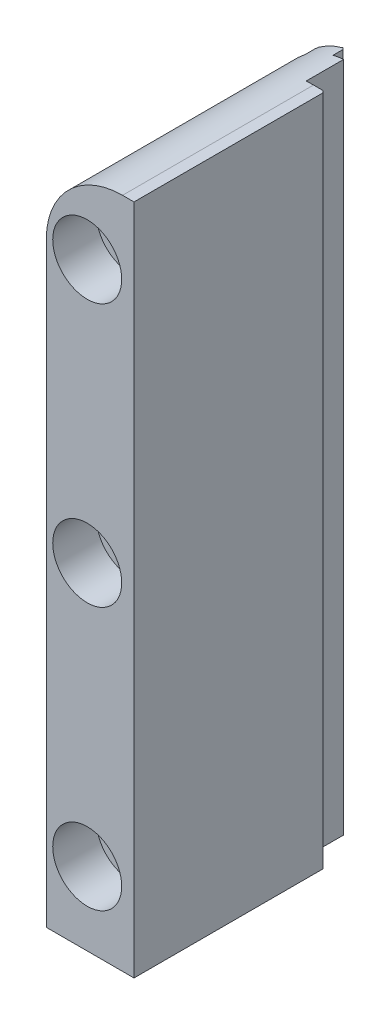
ISO-10303-21;
HEADER;
FILE_DESCRIPTION(('STEP AP214'),'2;1');
FILE_NAME('part.step','',(''),(''),'','','');
FILE_SCHEMA(('AUTOMOTIVE_DESIGN { 1 0 10303 214 1 1 1 1 }'));
ENDSEC;
DATA;
#1=APPLICATION_CONTEXT('core data for automotive mechanical design processes');
#2=APPLICATION_PROTOCOL_DEFINITION('international standard','automotive_design',2000,#1);
#3=PRODUCT_CONTEXT('',#1,'mechanical');
#4=PRODUCT('Part','Part','',(#3));
#5=PRODUCT_RELATED_PRODUCT_CATEGORY('part','',(#4));
#6=PRODUCT_DEFINITION_FORMATION('','',#4);
#7=PRODUCT_DEFINITION_CONTEXT('part definition',#1,'design');
#8=PRODUCT_DEFINITION('design','',#6,#7);
#9=PRODUCT_DEFINITION_SHAPE('','',#8);
#10=(LENGTH_UNIT() NAMED_UNIT(*) SI_UNIT(.MILLI.,.METRE.));
#11=(NAMED_UNIT(*) PLANE_ANGLE_UNIT() SI_UNIT($,.RADIAN.));
#12=(NAMED_UNIT(*) SI_UNIT($,.STERADIAN.) SOLID_ANGLE_UNIT());
#13=UNCERTAINTY_MEASURE_WITH_UNIT(LENGTH_MEASURE(1.E-05),#10,'distance_accuracy_value','');
#14=(GEOMETRIC_REPRESENTATION_CONTEXT(3) GLOBAL_UNCERTAINTY_ASSIGNED_CONTEXT((#13)) GLOBAL_UNIT_ASSIGNED_CONTEXT((#10,
#11,#12)) REPRESENTATION_CONTEXT('',''));
#15=CARTESIAN_POINT('',(0.,0.,0.));
#16=DIRECTION('',(0.,0.,1.));
#17=DIRECTION('',(1.,0.,0.));
#18=AXIS2_PLACEMENT_3D('',#15,#16,#17);
#19=CARTESIAN_POINT('',(-7.32028,42.545,-28.956));
#20=DIRECTION('',(0.,0.,-1.));
#21=DIRECTION('',(1.,0.,0.));
#22=AXIS2_PLACEMENT_3D('',#19,#20,#21);
#23=PLANE('',#22);
#24=CARTESIAN_POINT('',(-5.92328,-33.274,-28.956));
#25=DIRECTION('',(0.,0.,-1.));
#26=DIRECTION('',(-1.,0.,0.));
#27=AXIS2_PLACEMENT_3D('',#24,#25,#26);
#28=CIRCLE('',#27,2.7051);
#29=CARTESIAN_POINT('',(-8.62838,-33.274,-28.956));
#30=VERTEX_POINT('',#29);
#31=EDGE_CURVE('E499',#30,#30,#28,.T.);
#32=ORIENTED_EDGE('',*,*,#31,.F.);
#33=EDGE_LOOP('',(#32));
#34=FACE_BOUND('',#33,.T.);
#35=CARTESIAN_POINT('',(-5.92328,0.,-28.956));
#36=DIRECTION('',(0.,0.,-1.));
#37=DIRECTION('',(-1.,0.,0.));
#38=AXIS2_PLACEMENT_3D('',#35,#36,#37);
#39=CIRCLE('',#38,2.7051);
#40=CARTESIAN_POINT('',(-8.62838,0.,-28.956));
#41=VERTEX_POINT('',#40);
#42=EDGE_CURVE('E502',#41,#41,#39,.T.);
#43=ORIENTED_EDGE('',*,*,#42,.F.);
#44=EDGE_LOOP('',(#43));
#45=FACE_BOUND('',#44,.T.);
#46=CARTESIAN_POINT('',(-5.92328,33.274,-28.956));
#47=DIRECTION('',(0.,0.,-1.));
#48=DIRECTION('',(-1.,0.,0.));
#49=AXIS2_PLACEMENT_3D('',#46,#47,#48);
#50=CIRCLE('',#49,2.7051);
#51=CARTESIAN_POINT('',(-8.62838,33.274,-28.956));
#52=VERTEX_POINT('',#51);
#53=EDGE_CURVE('E506',#52,#52,#50,.T.);
#54=ORIENTED_EDGE('',*,*,#53,.F.);
#55=EDGE_LOOP('',(#54));
#56=FACE_BOUND('',#55,.T.);
#57=DIRECTION('',(-0.999999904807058,0.000436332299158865,0.));
#58=VECTOR('',#57,1.);
#59=CARTESIAN_POINT('',(-7.32432497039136,33.2746113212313,-28.956));
#60=LINE('',#59,#58);
#61=CARTESIAN_POINT('',(-2.74802630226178,33.2726145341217,-28.956));
#62=VERTEX_POINT('',#61);
#63=CARTESIAN_POINT('',(-2.7482803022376,33.2726146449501,-28.956));
#64=VERTEX_POINT('',#63);
#65=EDGE_CURVE('E312',#62,#64,#60,.T.);
#66=ORIENTED_EDGE('',*,*,#65,.T.);
#67=CARTESIAN_POINT('',(-5.92328,33.274,-28.956));
#68=DIRECTION('',(0.,0.,1.));
#69=DIRECTION('',(1.,0.,0.));
#70=AXIS2_PLACEMENT_3D('',#67,#68,#69);
#71=CIRCLE('',#70,3.175);
#72=CARTESIAN_POINT('',(-2.74828,33.274,-28.956));
#73=VERTEX_POINT('',#72);
#74=EDGE_CURVE('E496',#73,#64,#71,.T.);
#75=ORIENTED_EDGE('',*,*,#74,.F.);
#76=DIRECTION('',(-1.,0.,0.));
#77=VECTOR('',#76,1.);
#78=CARTESIAN_POINT('',(-7.32028,33.274,-28.956));
#79=LINE('',#78,#77);
#80=CARTESIAN_POINT('',(-2.748026,33.274,-28.956));
#81=VERTEX_POINT('',#80);
#82=EDGE_CURVE('E395',#73,#81,#79,.F.);
#83=ORIENTED_EDGE('',*,*,#82,.T.);
#84=CARTESIAN_POINT('',(-5.92328,33.274,-28.956));
#85=DIRECTION('',(0.,0.,-1.));
#86=DIRECTION('',(-1.,0.,0.));
#87=AXIS2_PLACEMENT_3D('',#84,#85,#86);
#88=CIRCLE('',#87,3.175254);
#89=CARTESIAN_POINT('',(-3.76428,35.6022948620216,-28.956));
#90=VERTEX_POINT('',#89);
#91=EDGE_CURVE('E733',#90,#81,#88,.T.);
#92=ORIENTED_EDGE('',*,*,#91,.F.);
#93=DIRECTION('',(0.,-1.,0.));
#94=VECTOR('',#93,1.);
#95=CARTESIAN_POINT('',(-3.76428,42.545,-28.956));
#96=LINE('',#95,#94);
#97=CARTESIAN_POINT('',(-3.76428,42.2641543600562,-28.956));
#98=VERTEX_POINT('',#97);
#99=EDGE_CURVE('E321',#98,#90,#96,.T.);
#100=ORIENTED_EDGE('',*,*,#99,.F.);
#101=CARTESIAN_POINT('',(-1.45288,32.893,-28.956));
#102=DIRECTION('',(0.,0.,1.));
#103=DIRECTION('',(1.,0.,0.));
#104=AXIS2_PLACEMENT_3D('',#101,#102,#103);
#105=CIRCLE('',#104,9.652);
#106=CARTESIAN_POINT('',(-2.40538,42.4978866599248,-28.956));
#107=VERTEX_POINT('',#106);
#108=EDGE_CURVE('E549',#107,#98,#105,.T.);
#109=ORIENTED_EDGE('',*,*,#108,.F.);
#110=DIRECTION('',(0.,-1.,0.));
#111=VECTOR('',#110,1.);
#112=CARTESIAN_POINT('',(-2.40538,42.545,-28.956));
#113=LINE('',#112,#111);
#114=CARTESIAN_POINT('',(-2.40538,-42.545,-28.956));
#115=VERTEX_POINT('',#114);
#116=EDGE_CURVE('E566',#107,#115,#113,.T.);
#117=ORIENTED_EDGE('',*,*,#116,.T.);
#118=DIRECTION('',(-1.,0.,0.));
#119=VECTOR('',#118,1.);
#120=CARTESIAN_POINT('',(-2.34188,-42.545,-28.956));
#121=LINE('',#120,#119);
#122=CARTESIAN_POINT('',(-3.76428,-42.545,-28.956));
#123=VERTEX_POINT('',#122);
#124=EDGE_CURVE('E513',#115,#123,#121,.T.);
#125=ORIENTED_EDGE('',*,*,#124,.T.);
#126=CARTESIAN_POINT('',(-3.76428,-35.6022948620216,-28.956));
#127=VERTEX_POINT('',#126);
#128=EDGE_CURVE('E336',#127,#123,#96,.T.);
#129=ORIENTED_EDGE('',*,*,#128,.F.);
#130=CARTESIAN_POINT('',(-5.92328,-33.274,-28.956));
#131=DIRECTION('',(0.,0.,-1.));
#132=DIRECTION('',(-1.,0.,0.));
#133=AXIS2_PLACEMENT_3D('',#130,#131,#132);
#134=CIRCLE('',#133,3.175254);
#135=CARTESIAN_POINT('',(-2.74802630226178,-33.2753854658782,-28.956));
#136=VERTEX_POINT('',#135);
#137=EDGE_CURVE('E452',#136,#127,#134,.T.);
#138=ORIENTED_EDGE('',*,*,#137,.F.);
#139=DIRECTION('',(-0.999999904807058,0.00043633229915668,0.));
#140=VECTOR('',#139,1.);
#141=CARTESIAN_POINT('',(-7.3533620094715,-33.2733760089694,-28.956));
#142=LINE('',#141,#140);
#143=CARTESIAN_POINT('',(-2.7482803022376,-33.2753853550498,-28.956));
#144=VERTEX_POINT('',#143);
#145=EDGE_CURVE('E471',#136,#144,#142,.T.);
#146=ORIENTED_EDGE('',*,*,#145,.T.);
#147=CARTESIAN_POINT('',(-5.92328,-33.274,-28.956));
#148=DIRECTION('',(0.,0.,1.));
#149=DIRECTION('',(1.,0.,0.));
#150=AXIS2_PLACEMENT_3D('',#147,#148,#149);
#151=CIRCLE('',#150,3.175);
#152=CARTESIAN_POINT('',(-2.74828,-33.274,-28.956));
#153=VERTEX_POINT('',#152);
#154=EDGE_CURVE('E491',#153,#144,#151,.T.);
#155=ORIENTED_EDGE('',*,*,#154,.F.);
#156=DIRECTION('',(-1.,0.,0.));
#157=VECTOR('',#156,1.);
#158=CARTESIAN_POINT('',(-7.32028,-33.274,-28.956));
#159=LINE('',#158,#157);
#160=CARTESIAN_POINT('',(-2.748026,-33.274,-28.956));
#161=VERTEX_POINT('',#160);
#162=EDGE_CURVE('E474',#153,#161,#159,.F.);
#163=ORIENTED_EDGE('',*,*,#162,.T.);
#164=CARTESIAN_POINT('',(-3.76428,-30.9457051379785,-28.956));
#165=VERTEX_POINT('',#164);
#166=EDGE_CURVE('E455',#165,#161,#134,.T.);
#167=ORIENTED_EDGE('',*,*,#166,.F.);
#168=CARTESIAN_POINT('',(-3.76428,-2.32829486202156,-28.956));
#169=VERTEX_POINT('',#168);
#170=EDGE_CURVE('E322',#169,#165,#96,.T.);
#171=ORIENTED_EDGE('',*,*,#170,.F.);
#172=CARTESIAN_POINT('',(-5.92328,0.,-28.956));
#173=DIRECTION('',(0.,0.,-1.));
#174=DIRECTION('',(-1.,0.,0.));
#175=AXIS2_PLACEMENT_3D('',#172,#173,#174);
#176=CIRCLE('',#175,3.175254);
#177=CARTESIAN_POINT('',(-2.74802630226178,-0.00138546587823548,-28.956));
#178=VERTEX_POINT('',#177);
#179=EDGE_CURVE('E414',#178,#169,#176,.T.);
#180=ORIENTED_EDGE('',*,*,#179,.F.);
#181=DIRECTION('',(-0.999999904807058,0.000436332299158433,0.));
#182=VECTOR('',#181,1.);
#183=CARTESIAN_POINT('',(-7.33884348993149,0.000617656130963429,-28.956));
#184=LINE('',#183,#182);
#185=CARTESIAN_POINT('',(-2.7482803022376,-0.00138535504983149,-28.956));
#186=VERTEX_POINT('',#185);
#187=EDGE_CURVE('E394',#178,#186,#184,.T.);
#188=ORIENTED_EDGE('',*,*,#187,.T.);
#189=CARTESIAN_POINT('',(-5.92328,0.,-28.956));
#190=DIRECTION('',(0.,0.,1.));
#191=DIRECTION('',(1.,0.,0.));
#192=AXIS2_PLACEMENT_3D('',#189,#190,#191);
#193=CIRCLE('',#192,3.175);
#194=CARTESIAN_POINT('',(-2.74828,0.,-28.956));
#195=VERTEX_POINT('',#194);
#196=EDGE_CURVE('E493',#195,#186,#193,.T.);
#197=ORIENTED_EDGE('',*,*,#196,.F.);
#198=DIRECTION('',(-1.,0.,0.));
#199=VECTOR('',#198,1.);
#200=CARTESIAN_POINT('',(-7.32028,0.,-28.956));
#201=LINE('',#200,#199);
#202=CARTESIAN_POINT('',(-2.748026,0.,-28.956));
#203=VERTEX_POINT('',#202);
#204=EDGE_CURVE('E380',#195,#203,#201,.F.);
#205=ORIENTED_EDGE('',*,*,#204,.T.);
#206=CARTESIAN_POINT('',(-3.76428,2.32829486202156,-28.956));
#207=VERTEX_POINT('',#206);
#208=EDGE_CURVE('E415',#207,#203,#176,.T.);
#209=ORIENTED_EDGE('',*,*,#208,.F.);
#210=CARTESIAN_POINT('',(-3.76428,30.9457051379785,-28.956));
#211=VERTEX_POINT('',#210);
#212=EDGE_CURVE('E319',#211,#207,#96,.T.);
#213=ORIENTED_EDGE('',*,*,#212,.F.);
#214=EDGE_CURVE('E793',#62,#211,#88,.T.);
#215=ORIENTED_EDGE('',*,*,#214,.F.);
#216=EDGE_LOOP('',(#66,#75,#83,#92,#100,#109,#117,#125,#129,#138,#146,#155,#163,#167,#171,#180,
#188,#197,#205,#209,#213,#215));
#217=FACE_BOUND('',#216,.T.);
#218=ADVANCED_FACE('F15',(#34,#45,#56,#217),#23,.T.);
#219=CARTESIAN_POINT('',(-5.92328,33.274,-18.5166));
#220=DIRECTION('',(0.,0.,1.));
#221=DIRECTION('',(1.,0.,0.));
#222=AXIS2_PLACEMENT_3D('',#219,#220,#221);
#223=CONICAL_SURFACE('',#222,3.3147,0.785398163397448);
#224=CARTESIAN_POINT('',(-5.92328,33.274,-19.1262));
#225=DIRECTION('',(0.,0.,1.));
#226=DIRECTION('',(1.,0.,0.));
#227=AXIS2_PLACEMENT_3D('',#224,#225,#226);
#228=CIRCLE('',#227,2.7051);
#229=CARTESIAN_POINT('',(-3.21818,33.274,-19.1262));
#230=VERTEX_POINT('',#229);
#231=EDGE_CURVE('E494',#230,#230,#228,.T.);
#232=ORIENTED_EDGE('',*,*,#231,.F.);
#233=EDGE_LOOP('',(#232));
#234=FACE_BOUND('',#233,.T.);
#235=CARTESIAN_POINT('',(-5.92328,33.274,-18.5166));
#236=DIRECTION('',(0.,0.,-1.));
#237=DIRECTION('',(-1.,0.,0.));
#238=AXIS2_PLACEMENT_3D('',#235,#236,#237);
#239=CIRCLE('',#238,3.3147);
#240=CARTESIAN_POINT('',(-9.23798,33.274,-18.5166));
#241=VERTEX_POINT('',#240);
#242=EDGE_CURVE('E486',#241,#241,#239,.T.);
#243=ORIENTED_EDGE('',*,*,#242,.F.);
#244=EDGE_LOOP('',(#243));
#245=FACE_BOUND('',#244,.T.);
#246=CARTESIAN_POINT('',(-5.92328,33.274,-18.6563));
#247=DIRECTION('',(0.,0.,1.));
#248=DIRECTION('',(1.,0.,0.));
#249=AXIS2_PLACEMENT_3D('',#246,#247,#248);
#250=CIRCLE('',#249,3.175);
#251=CARTESIAN_POINT('',(-2.7482803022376,33.2726146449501,-18.6563));
#252=VERTEX_POINT('',#251);
#253=CARTESIAN_POINT('',(-2.74828,33.274,-18.6563));
#254=VERTEX_POINT('',#253);
#255=EDGE_CURVE('E9',#252,#254,#250,.F.);
#256=ORIENTED_EDGE('',*,*,#255,.F.);
#257=DIRECTION('',(0.707106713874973,-0.000308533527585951,0.707106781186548));
#258=VECTOR('',#257,1.);
#259=CARTESIAN_POINT('',(-5.92328,33.274,-21.8313));
#260=LINE('',#259,#258);
#261=CARTESIAN_POINT('',(-2.74802630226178,33.2726145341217,-18.656046));
#262=VERTEX_POINT('',#261);
#263=EDGE_CURVE('E304',#262,#252,#260,.F.);
#264=ORIENTED_EDGE('',*,*,#263,.F.);
#265=CARTESIAN_POINT('',(-5.92328,33.274,-18.656046));
#266=DIRECTION('',(0.,0.,1.));
#267=DIRECTION('',(1.,0.,0.));
#268=AXIS2_PLACEMENT_3D('',#265,#266,#267);
#269=CIRCLE('',#268,3.175254);
#270=CARTESIAN_POINT('',(-2.748026,33.274,-18.656046));
#271=VERTEX_POINT('',#270);
#272=EDGE_CURVE('E296',#262,#271,#269,.F.);
#273=ORIENTED_EDGE('',*,*,#272,.T.);
#274=DIRECTION('',(0.707106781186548,0.,0.707106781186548));
#275=VECTOR('',#274,1.);
#276=CARTESIAN_POINT('',(-5.92328,33.274,-21.8313));
#277=LINE('',#276,#275);
#278=EDGE_CURVE('E25',#254,#271,#277,.T.);
#279=ORIENTED_EDGE('',*,*,#278,.F.);
#280=EDGE_LOOP('',(#256,#264,#273,#279));
#281=FACE_BOUND('',#280,.T.);
#282=ADVANCED_FACE('F315',(#234,#245,#281),#223,.F.);
#283=CARTESIAN_POINT('',(-7.32028,30.4225742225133,-28.956));
#284=VERTEX_POINT('',#283);
#285=CARTESIAN_POINT('',(-7.32028,36.1254257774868,-28.956));
#286=VERTEX_POINT('',#285);
#287=EDGE_CURVE('E789',#284,#286,#88,.T.);
#288=ORIENTED_EDGE('',*,*,#287,.F.);
#289=DIRECTION('',(0.,-1.,0.));
#290=VECTOR('',#289,1.);
#291=CARTESIAN_POINT('',(-7.32028,42.545,-28.956));
#292=LINE('',#291,#290);
#293=CARTESIAN_POINT('',(-7.32028,2.85142577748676,-28.956));
#294=VERTEX_POINT('',#293);
#295=EDGE_CURVE('E19',#284,#294,#292,.T.);
#296=ORIENTED_EDGE('',*,*,#295,.T.);
#297=CARTESIAN_POINT('',(-7.32028,-2.85142577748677,-28.956));
#298=VERTEX_POINT('',#297);
#299=EDGE_CURVE('E410',#298,#294,#176,.T.);
#300=ORIENTED_EDGE('',*,*,#299,.F.);
#301=CARTESIAN_POINT('',(-7.32028,-30.4225742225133,-28.956));
#302=VERTEX_POINT('',#301);
#303=EDGE_CURVE('E342',#298,#302,#292,.T.);
#304=ORIENTED_EDGE('',*,*,#303,.T.);
#305=CARTESIAN_POINT('',(-7.32028,-36.1254257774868,-28.956));
#306=VERTEX_POINT('',#305);
#307=EDGE_CURVE('E456',#306,#302,#134,.T.);
#308=ORIENTED_EDGE('',*,*,#307,.F.);
#309=CARTESIAN_POINT('',(-7.32028,-42.545,-28.956));
#310=VERTEX_POINT('',#309);
#311=EDGE_CURVE('E343',#306,#310,#292,.T.);
#312=ORIENTED_EDGE('',*,*,#311,.T.);
#313=DIRECTION('',(-1.,0.,0.));
#314=VECTOR('',#313,1.);
#315=CARTESIAN_POINT('',(-7.32028,-42.545,-28.956));
#316=LINE('',#315,#314);
#317=CARTESIAN_POINT('',(-11.10488,-42.545,-28.956));
#318=VERTEX_POINT('',#317);
#319=EDGE_CURVE('E524',#310,#318,#316,.T.);
#320=ORIENTED_EDGE('',*,*,#319,.T.);
#321=DIRECTION('',(0.,-1.,0.));
#322=VECTOR('',#321,1.);
#323=CARTESIAN_POINT('',(-11.10488,42.545,-28.956));
#324=LINE('',#323,#322);
#325=CARTESIAN_POINT('',(-11.10488,32.893,-28.956));
#326=VERTEX_POINT('',#325);
#327=EDGE_CURVE('E350',#326,#318,#324,.T.);
#328=ORIENTED_EDGE('',*,*,#327,.F.);
#329=CARTESIAN_POINT('',(-1.45288,32.893,-28.956));
#330=DIRECTION('',(0.,0.,1.));
#331=DIRECTION('',(1.,0.,0.));
#332=AXIS2_PLACEMENT_3D('',#329,#330,#331);
#333=CIRCLE('',#332,9.652);
#334=CARTESIAN_POINT('',(-7.32028,40.5568581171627,-28.956));
#335=VERTEX_POINT('',#334);
#336=EDGE_CURVE('E538',#335,#326,#333,.T.);
#337=ORIENTED_EDGE('',*,*,#336,.F.);
#338=EDGE_CURVE('E349',#335,#286,#292,.T.);
#339=ORIENTED_EDGE('',*,*,#338,.T.);
#340=EDGE_LOOP('',(#288,#296,#300,#304,#308,#312,#320,#328,#337,#339));
#341=FACE_BOUND('',#340,.T.);
#342=ADVANCED_FACE('F706',(#341),#23,.T.);
#343=CARTESIAN_POINT('',(-5.92328,0.,-18.5166));
#344=DIRECTION('',(0.,0.,1.));
#345=DIRECTION('',(1.,0.,0.));
#346=AXIS2_PLACEMENT_3D('',#343,#344,#345);
#347=CONICAL_SURFACE('',#346,3.3147,0.785398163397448);
#348=CARTESIAN_POINT('',(-5.92328,0.,-19.1262));
#349=DIRECTION('',(0.,0.,1.));
#350=DIRECTION('',(1.,0.,0.));
#351=AXIS2_PLACEMENT_3D('',#348,#349,#350);
#352=CIRCLE('',#351,2.7051);
#353=CARTESIAN_POINT('',(-3.21818,0.,-19.1262));
#354=VERTEX_POINT('',#353);
#355=EDGE_CURVE('E490',#354,#354,#352,.T.);
#356=ORIENTED_EDGE('',*,*,#355,.F.);
#357=EDGE_LOOP('',(#356));
#358=FACE_BOUND('',#357,.T.);
#359=CARTESIAN_POINT('',(-5.92328,0.,-18.5166));
#360=DIRECTION('',(0.,0.,-1.));
#361=DIRECTION('',(-1.,0.,0.));
#362=AXIS2_PLACEMENT_3D('',#359,#360,#361);
#363=CIRCLE('',#362,3.3147);
#364=CARTESIAN_POINT('',(-9.23798,0.,-18.5166));
#365=VERTEX_POINT('',#364);
#366=EDGE_CURVE('E481',#365,#365,#363,.T.);
#367=ORIENTED_EDGE('',*,*,#366,.F.);
#368=EDGE_LOOP('',(#367));
#369=FACE_BOUND('',#368,.T.);
#370=CARTESIAN_POINT('',(-5.92328,0.,-18.6563));
#371=DIRECTION('',(0.,0.,1.));
#372=DIRECTION('',(1.,0.,0.));
#373=AXIS2_PLACEMENT_3D('',#370,#371,#372);
#374=CIRCLE('',#373,3.175);
#375=CARTESIAN_POINT('',(-2.7482803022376,-0.00138535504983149,-18.6563));
#376=VERTEX_POINT('',#375);
#377=CARTESIAN_POINT('',(-2.74828,0.,-18.6563));
#378=VERTEX_POINT('',#377);
#379=EDGE_CURVE('E305',#376,#378,#374,.F.);
#380=ORIENTED_EDGE('',*,*,#379,.F.);
#381=DIRECTION('',(0.707106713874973,-0.000308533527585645,0.707106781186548));
#382=VECTOR('',#381,1.);
#383=CARTESIAN_POINT('',(-5.92328,0.,-21.8313));
#384=LINE('',#383,#382);
#385=CARTESIAN_POINT('',(-2.74802630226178,-0.00138546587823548,-18.656046));
#386=VERTEX_POINT('',#385);
#387=EDGE_CURVE('E359',#386,#376,#384,.F.);
#388=ORIENTED_EDGE('',*,*,#387,.F.);
#389=CARTESIAN_POINT('',(-5.92328,0.,-18.656046));
#390=DIRECTION('',(0.,0.,1.));
#391=DIRECTION('',(1.,0.,0.));
#392=AXIS2_PLACEMENT_3D('',#389,#390,#391);
#393=CIRCLE('',#392,3.175254);
#394=CARTESIAN_POINT('',(-2.748026,0.,-18.656046));
#395=VERTEX_POINT('',#394);
#396=EDGE_CURVE('E356',#386,#395,#393,.F.);
#397=ORIENTED_EDGE('',*,*,#396,.T.);
#398=DIRECTION('',(0.707106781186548,0.,0.707106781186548));
#399=VECTOR('',#398,1.);
#400=CARTESIAN_POINT('',(-5.92328,0.,-21.8313));
#401=LINE('',#400,#399);
#402=EDGE_CURVE('E361',#378,#395,#401,.T.);
#403=ORIENTED_EDGE('',*,*,#402,.F.);
#404=EDGE_LOOP('',(#380,#388,#397,#403));
#405=FACE_BOUND('',#404,.T.);
#406=ADVANCED_FACE('F383',(#358,#369,#405),#347,.F.);
#407=CARTESIAN_POINT('',(-5.92328,-33.274,-18.5166));
#408=DIRECTION('',(0.,0.,1.));
#409=DIRECTION('',(1.,0.,0.));
#410=AXIS2_PLACEMENT_3D('',#407,#408,#409);
#411=CONICAL_SURFACE('',#410,3.3147,0.785398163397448);
#412=CARTESIAN_POINT('',(-5.92328,-33.274,-19.1262));
#413=DIRECTION('',(0.,0.,1.));
#414=DIRECTION('',(1.,0.,0.));
#415=AXIS2_PLACEMENT_3D('',#412,#413,#414);
#416=CIRCLE('',#415,2.7051);
#417=CARTESIAN_POINT('',(-3.21818,-33.274,-19.1262));
#418=VERTEX_POINT('',#417);
#419=EDGE_CURVE('E485',#418,#418,#416,.T.);
#420=ORIENTED_EDGE('',*,*,#419,.F.);
#421=EDGE_LOOP('',(#420));
#422=FACE_BOUND('',#421,.T.);
#423=CARTESIAN_POINT('',(-5.92328,-33.274,-18.5166));
#424=DIRECTION('',(0.,0.,-1.));
#425=DIRECTION('',(-1.,0.,0.));
#426=AXIS2_PLACEMENT_3D('',#423,#424,#425);
#427=CIRCLE('',#426,3.3147);
#428=CARTESIAN_POINT('',(-9.23798,-33.274,-18.5166));
#429=VERTEX_POINT('',#428);
#430=EDGE_CURVE('E477',#429,#429,#427,.T.);
#431=ORIENTED_EDGE('',*,*,#430,.F.);
#432=EDGE_LOOP('',(#431));
#433=FACE_BOUND('',#432,.T.);
#434=CARTESIAN_POINT('',(-5.92328,-33.274,-18.6563));
#435=DIRECTION('',(0.,0.,1.));
#436=DIRECTION('',(1.,0.,0.));
#437=AXIS2_PLACEMENT_3D('',#434,#435,#436);
#438=CIRCLE('',#437,3.175);
#439=CARTESIAN_POINT('',(-2.7482803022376,-33.2753853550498,-18.6563));
#440=VERTEX_POINT('',#439);
#441=CARTESIAN_POINT('',(-2.74828,-33.274,-18.6563));
#442=VERTEX_POINT('',#441);
#443=EDGE_CURVE('E360',#440,#442,#438,.F.);
#444=ORIENTED_EDGE('',*,*,#443,.F.);
#445=DIRECTION('',(0.707106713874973,-0.000308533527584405,0.707106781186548));
#446=VECTOR('',#445,1.);
#447=CARTESIAN_POINT('',(-5.92328,-33.274,-21.8313));
#448=LINE('',#447,#446);
#449=CARTESIAN_POINT('',(-2.74802630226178,-33.2753854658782,-18.656046));
#450=VERTEX_POINT('',#449);
#451=EDGE_CURVE('E651',#450,#440,#448,.F.);
#452=ORIENTED_EDGE('',*,*,#451,.F.);
#453=CARTESIAN_POINT('',(-5.92328,-33.274,-18.656046));
#454=DIRECTION('',(0.,0.,1.));
#455=DIRECTION('',(1.,0.,0.));
#456=AXIS2_PLACEMENT_3D('',#453,#454,#455);
#457=CIRCLE('',#456,3.175254);
#458=CARTESIAN_POINT('',(-2.748026,-33.274,-18.656046));
#459=VERTEX_POINT('',#458);
#460=EDGE_CURVE('E604',#450,#459,#457,.F.);
#461=ORIENTED_EDGE('',*,*,#460,.T.);
#462=DIRECTION('',(0.707106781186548,0.,0.707106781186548));
#463=VECTOR('',#462,1.);
#464=CARTESIAN_POINT('',(-5.92328,-33.274,-21.8313));
#465=LINE('',#464,#463);
#466=EDGE_CURVE('E653',#442,#459,#465,.T.);
#467=ORIENTED_EDGE('',*,*,#466,.F.);
#468=EDGE_LOOP('',(#444,#452,#461,#467));
#469=FACE_BOUND('',#468,.T.);
#470=ADVANCED_FACE('F666',(#422,#433,#469),#411,.F.);
#471=CARTESIAN_POINT('',(-3.76428,42.545,-28.956));
#472=DIRECTION('',(1.,0.,0.));
#473=DIRECTION('',(0.,0.,1.));
#474=AXIS2_PLACEMENT_3D('',#471,#472,#473);
#475=PLANE('',#474);
#476=DIRECTION('',(0.,0.,1.));
#477=VECTOR('',#476,1.);
#478=CARTESIAN_POINT('',(-3.76428,-35.6022948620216,-18.5166));
#479=LINE('',#478,#477);
#480=CARTESIAN_POINT('',(-3.76428,-35.6022948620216,-30.226));
#481=VERTEX_POINT('',#480);
#482=EDGE_CURVE('E450',#127,#481,#479,.F.);
#483=ORIENTED_EDGE('',*,*,#482,.F.);
#484=ORIENTED_EDGE('',*,*,#128,.T.);
#485=DIRECTION('',(0.,0.,-1.));
#486=VECTOR('',#485,1.);
#487=CARTESIAN_POINT('',(-3.76428,-42.545,-28.956));
#488=LINE('',#487,#486);
#489=CARTESIAN_POINT('',(-3.76428,-42.545,-30.226));
#490=VERTEX_POINT('',#489);
#491=EDGE_CURVE('E516',#123,#490,#488,.T.);
#492=ORIENTED_EDGE('',*,*,#491,.T.);
#493=DIRECTION('',(0.,1.,0.));
#494=VECTOR('',#493,1.);
#495=CARTESIAN_POINT('',(-3.76428,42.545,-30.226));
#496=LINE('',#495,#494);
#497=EDGE_CURVE('E592',#490,#481,#496,.T.);
#498=ORIENTED_EDGE('',*,*,#497,.T.);
#499=EDGE_LOOP('',(#483,#484,#492,#498));
#500=FACE_BOUND('',#499,.T.);
#501=ADVANCED_FACE('F678',(#500),#475,.T.);
#502=CARTESIAN_POINT('',(-7.32028,42.545,-30.226));
#503=DIRECTION('',(0.707106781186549,0.,0.707106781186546));
#504=DIRECTION('',(0.707106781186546,0.,-0.707106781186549));
#505=AXIS2_PLACEMENT_3D('',#502,#503,#504);
#506=PLANE('',#505);
#507=CARTESIAN_POINT('',(-5.92328,-33.274,-31.623));
#508=DIRECTION('',(0.707106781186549,0.,0.707106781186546));
#509=DIRECTION('',(-0.707106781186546,0.,0.707106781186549));
#510=AXIS2_PLACEMENT_3D('',#507,#508,#509);
#511=ELLIPSE('',#510,4.49048727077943,3.175254);
#512=CARTESIAN_POINT('',(-7.06628,-36.2363958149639,-30.48));
#513=VERTEX_POINT('',#512);
#514=CARTESIAN_POINT('',(-7.32028,-36.1254257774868,-30.226));
#515=VERTEX_POINT('',#514);
#516=EDGE_CURVE('E448',#513,#515,#511,.F.);
#517=ORIENTED_EDGE('',*,*,#516,.F.);
#518=DIRECTION('',(0.,1.,0.));
#519=VECTOR('',#518,1.);
#520=CARTESIAN_POINT('',(-7.06628,42.545,-30.48));
#521=LINE('',#520,#519);
#522=CARTESIAN_POINT('',(-7.06628,-42.545,-30.48));
#523=VERTEX_POINT('',#522);
#524=EDGE_CURVE('E582',#523,#513,#521,.T.);
#525=ORIENTED_EDGE('',*,*,#524,.F.);
#526=DIRECTION('',(-0.707106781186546,0.,0.707106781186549));
#527=VECTOR('',#526,1.);
#528=CARTESIAN_POINT('',(-7.32028,-42.545,-30.226));
#529=LINE('',#528,#527);
#530=CARTESIAN_POINT('',(-7.32028,-42.545,-30.226));
#531=VERTEX_POINT('',#530);
#532=EDGE_CURVE('E571',#531,#523,#529,.F.);
#533=ORIENTED_EDGE('',*,*,#532,.F.);
#534=DIRECTION('',(0.,-1.,0.));
#535=VECTOR('',#534,1.);
#536=CARTESIAN_POINT('',(-7.32028,42.545,-30.226));
#537=LINE('',#536,#535);
#538=EDGE_CURVE('E600',#515,#531,#537,.T.);
#539=ORIENTED_EDGE('',*,*,#538,.F.);
#540=EDGE_LOOP('',(#517,#525,#533,#539));
#541=FACE_BOUND('',#540,.T.);
#542=ADVANCED_FACE('F693',(#541),#506,.F.);
#543=CARTESIAN_POINT('',(-3.76428,42.545,-30.48));
#544=DIRECTION('',(0.,0.,-1.));
#545=DIRECTION('',(1.,0.,0.));
#546=AXIS2_PLACEMENT_3D('',#543,#544,#545);
#547=PLANE('',#546);
#548=CARTESIAN_POINT('',(-5.92328,0.,-30.48));
#549=DIRECTION('',(0.,0.,-1.));
#550=DIRECTION('',(-1.,0.,0.));
#551=AXIS2_PLACEMENT_3D('',#548,#549,#550);
#552=CIRCLE('',#551,3.175254);
#553=CARTESIAN_POINT('',(-4.01828,-2.54031749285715,-30.48));
#554=VERTEX_POINT('',#553);
#555=CARTESIAN_POINT('',(-7.06628,-2.96239581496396,-30.48));
#556=VERTEX_POINT('',#555);
#557=EDGE_CURVE('E424',#554,#556,#552,.T.);
#558=ORIENTED_EDGE('',*,*,#557,.F.);
#559=DIRECTION('',(0.,-1.,0.));
#560=VECTOR('',#559,1.);
#561=CARTESIAN_POINT('',(-4.01828,42.545,-30.48));
#562=LINE('',#561,#560);
#563=CARTESIAN_POINT('',(-4.01828,-30.7336825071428,-30.48));
#564=VERTEX_POINT('',#563);
#565=EDGE_CURVE('E759',#554,#564,#562,.T.);
#566=ORIENTED_EDGE('',*,*,#565,.T.);
#567=CARTESIAN_POINT('',(-5.92328,-33.274,-30.48));
#568=DIRECTION('',(0.,0.,-1.));
#569=DIRECTION('',(-1.,0.,0.));
#570=AXIS2_PLACEMENT_3D('',#567,#568,#569);
#571=CIRCLE('',#570,3.175254);
#572=CARTESIAN_POINT('',(-7.06628,-30.3116041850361,-30.48));
#573=VERTEX_POINT('',#572);
#574=EDGE_CURVE('E463',#573,#564,#571,.T.);
#575=ORIENTED_EDGE('',*,*,#574,.F.);
#576=EDGE_CURVE('E586',#573,#556,#521,.T.);
#577=ORIENTED_EDGE('',*,*,#576,.T.);
#578=EDGE_LOOP('',(#558,#566,#575,#577));
#579=FACE_BOUND('',#578,.T.);
#580=ADVANCED_FACE('F764',(#579),#547,.T.);
#581=CARTESIAN_POINT('',(-7.32028,42.545,-30.48));
#582=DIRECTION('',(-1.,0.,0.));
#583=DIRECTION('',(0.,0.,-1.));
#584=AXIS2_PLACEMENT_3D('',#581,#582,#583);
#585=PLANE('',#584);
#586=DIRECTION('',(0.,0.,1.));
#587=VECTOR('',#586,1.);
#588=CARTESIAN_POINT('',(-7.32028,-2.85142577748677,-18.5166));
#589=LINE('',#588,#587);
#590=CARTESIAN_POINT('',(-7.32028,-2.85142577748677,-30.226));
#591=VERTEX_POINT('',#590);
#592=EDGE_CURVE('E417',#591,#298,#589,.T.);
#593=ORIENTED_EDGE('',*,*,#592,.F.);
#594=CARTESIAN_POINT('',(-7.32028,-30.4225742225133,-30.226));
#595=VERTEX_POINT('',#594);
#596=EDGE_CURVE('E926',#591,#595,#537,.T.);
#597=ORIENTED_EDGE('',*,*,#596,.T.);
#598=DIRECTION('',(0.,0.,1.));
#599=VECTOR('',#598,1.);
#600=CARTESIAN_POINT('',(-7.32028,-30.4225742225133,-18.5166));
#601=LINE('',#600,#599);
#602=EDGE_CURVE('E458',#302,#595,#601,.F.);
#603=ORIENTED_EDGE('',*,*,#602,.F.);
#604=ORIENTED_EDGE('',*,*,#303,.F.);
#605=EDGE_LOOP('',(#593,#597,#603,#604));
#606=FACE_BOUND('',#605,.T.);
#607=ADVANCED_FACE('F916',(#606),#585,.T.);
#608=CARTESIAN_POINT('',(-4.01828,42.545,-30.48));
#609=DIRECTION('',(-0.707106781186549,0.,0.707106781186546));
#610=DIRECTION('',(0.707106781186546,0.,0.707106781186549));
#611=AXIS2_PLACEMENT_3D('',#608,#609,#610);
#612=PLANE('',#611);
#613=CARTESIAN_POINT('',(-5.92328,0.,-32.385));
#614=DIRECTION('',(-0.707106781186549,0.,0.707106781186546));
#615=DIRECTION('',(0.707106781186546,0.,0.707106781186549));
#616=AXIS2_PLACEMENT_3D('',#613,#614,#615);
#617=ELLIPSE('',#616,4.49048727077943,3.175254);
#618=CARTESIAN_POINT('',(-3.76428,-2.32829486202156,-30.226));
#619=VERTEX_POINT('',#618);
#620=EDGE_CURVE('E426',#619,#554,#617,.F.);
#621=ORIENTED_EDGE('',*,*,#620,.F.);
#622=CARTESIAN_POINT('',(-3.76428,-30.9457051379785,-30.226));
#623=VERTEX_POINT('',#622);
#624=EDGE_CURVE('E596',#623,#619,#496,.T.);
#625=ORIENTED_EDGE('',*,*,#624,.F.);
#626=CARTESIAN_POINT('',(-5.92328,-33.274,-32.385));
#627=DIRECTION('',(-0.707106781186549,0.,0.707106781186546));
#628=DIRECTION('',(0.707106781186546,0.,0.707106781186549));
#629=AXIS2_PLACEMENT_3D('',#626,#627,#628);
#630=ELLIPSE('',#629,4.49048727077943,3.175254);
#631=EDGE_CURVE('E466',#564,#623,#630,.F.);
#632=ORIENTED_EDGE('',*,*,#631,.F.);
#633=ORIENTED_EDGE('',*,*,#565,.F.);
#634=EDGE_LOOP('',(#621,#625,#632,#633));
#635=FACE_BOUND('',#634,.T.);
#636=ADVANCED_FACE('F757',(#635),#612,.F.);
#637=DIRECTION('',(0.,0.,1.));
#638=VECTOR('',#637,1.);
#639=CARTESIAN_POINT('',(-3.76428,-2.32829486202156,-18.5166));
#640=LINE('',#639,#638);
#641=EDGE_CURVE('E428',#169,#619,#640,.F.);
#642=ORIENTED_EDGE('',*,*,#641,.F.);
#643=ORIENTED_EDGE('',*,*,#170,.T.);
#644=DIRECTION('',(0.,0.,1.));
#645=VECTOR('',#644,1.);
#646=CARTESIAN_POINT('',(-3.76428,-30.9457051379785,-18.5166));
#647=LINE('',#646,#645);
#648=EDGE_CURVE('E468',#623,#165,#647,.T.);
#649=ORIENTED_EDGE('',*,*,#648,.F.);
#650=ORIENTED_EDGE('',*,*,#624,.T.);
#651=EDGE_LOOP('',(#642,#643,#649,#650));
#652=FACE_BOUND('',#651,.T.);
#653=ADVANCED_FACE('F752',(#652),#475,.T.);
#654=CARTESIAN_POINT('',(-5.92328,0.,-31.623));
#655=DIRECTION('',(0.707106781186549,0.,0.707106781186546));
#656=DIRECTION('',(-0.707106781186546,0.,0.707106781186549));
#657=AXIS2_PLACEMENT_3D('',#654,#655,#656);
#658=ELLIPSE('',#657,4.49048727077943,3.175254);
#659=EDGE_CURVE('E422',#556,#591,#658,.F.);
#660=ORIENTED_EDGE('',*,*,#659,.F.);
#661=ORIENTED_EDGE('',*,*,#576,.F.);
#662=CARTESIAN_POINT('',(-5.92328,-33.274,-31.623));
#663=DIRECTION('',(0.707106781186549,0.,0.707106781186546));
#664=DIRECTION('',(-0.707106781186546,0.,0.707106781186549));
#665=AXIS2_PLACEMENT_3D('',#662,#663,#664);
#666=ELLIPSE('',#665,4.49048727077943,3.175254);
#667=EDGE_CURVE('E461',#595,#573,#666,.F.);
#668=ORIENTED_EDGE('',*,*,#667,.F.);
#669=ORIENTED_EDGE('',*,*,#596,.F.);
#670=EDGE_LOOP('',(#660,#661,#668,#669));
#671=FACE_BOUND('',#670,.T.);
#672=ADVANCED_FACE('F840',(#671),#506,.F.);
#673=CARTESIAN_POINT('',(-5.92328,33.274,-30.48));
#674=DIRECTION('',(0.,0.,-1.));
#675=DIRECTION('',(-1.,0.,0.));
#676=AXIS2_PLACEMENT_3D('',#673,#674,#675);
#677=CIRCLE('',#676,3.175254);
#678=CARTESIAN_POINT('',(-4.01828,30.7336825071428,-30.48));
#679=VERTEX_POINT('',#678);
#680=CARTESIAN_POINT('',(-7.06628,30.3116041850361,-30.48));
#681=VERTEX_POINT('',#680);
#682=EDGE_CURVE('E805',#679,#681,#677,.T.);
#683=ORIENTED_EDGE('',*,*,#682,.F.);
#684=CARTESIAN_POINT('',(-4.01828,2.54031749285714,-30.48));
#685=VERTEX_POINT('',#684);
#686=EDGE_CURVE('E591',#679,#685,#562,.T.);
#687=ORIENTED_EDGE('',*,*,#686,.T.);
#688=CARTESIAN_POINT('',(-5.92328,0.,-30.48));
#689=DIRECTION('',(0.,0.,-1.));
#690=DIRECTION('',(-1.,0.,0.));
#691=AXIS2_PLACEMENT_3D('',#688,#689,#690);
#692=CIRCLE('',#691,3.175254);
#693=CARTESIAN_POINT('',(-7.06628,2.96239581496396,-30.48));
#694=VERTEX_POINT('',#693);
#695=EDGE_CURVE('E407',#694,#685,#692,.T.);
#696=ORIENTED_EDGE('',*,*,#695,.F.);
#697=EDGE_CURVE('E769',#694,#681,#521,.T.);
#698=ORIENTED_EDGE('',*,*,#697,.T.);
#699=EDGE_LOOP('',(#683,#687,#696,#698));
#700=FACE_BOUND('',#699,.T.);
#701=ADVANCED_FACE('F918',(#700),#547,.T.);
#702=DIRECTION('',(0.,0.,1.));
#703=VECTOR('',#702,1.);
#704=CARTESIAN_POINT('',(-7.32028,30.4225742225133,-18.5166));
#705=LINE('',#704,#703);
#706=CARTESIAN_POINT('',(-7.32028,30.4225742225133,-30.226));
#707=VERTEX_POINT('',#706);
#708=EDGE_CURVE('E798',#707,#284,#705,.T.);
#709=ORIENTED_EDGE('',*,*,#708,.F.);
#710=CARTESIAN_POINT('',(-7.32028,2.85142577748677,-30.226));
#711=VERTEX_POINT('',#710);
#712=EDGE_CURVE('E605',#707,#711,#537,.T.);
#713=ORIENTED_EDGE('',*,*,#712,.T.);
#714=DIRECTION('',(0.,0.,1.));
#715=VECTOR('',#714,1.);
#716=CARTESIAN_POINT('',(-7.32028,2.85142577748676,-18.5166));
#717=LINE('',#716,#715);
#718=EDGE_CURVE('E404',#294,#711,#717,.F.);
#719=ORIENTED_EDGE('',*,*,#718,.F.);
#720=ORIENTED_EDGE('',*,*,#295,.F.);
#721=EDGE_LOOP('',(#709,#713,#719,#720));
#722=FACE_BOUND('',#721,.T.);
#723=ADVANCED_FACE('F797',(#722),#585,.T.);
#724=CARTESIAN_POINT('',(-5.92328,33.274,-32.385));
#725=DIRECTION('',(-0.707106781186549,0.,0.707106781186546));
#726=DIRECTION('',(0.707106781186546,0.,0.707106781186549));
#727=AXIS2_PLACEMENT_3D('',#724,#725,#726);
#728=ELLIPSE('',#727,4.49048727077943,3.175254);
#729=CARTESIAN_POINT('',(-3.76428,30.9457051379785,-30.226));
#730=VERTEX_POINT('',#729);
#731=EDGE_CURVE('E811',#730,#679,#728,.F.);
#732=ORIENTED_EDGE('',*,*,#731,.F.);
#733=CARTESIAN_POINT('',(-3.76428,2.32829486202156,-30.226));
#734=VERTEX_POINT('',#733);
#735=EDGE_CURVE('E741',#734,#730,#496,.T.);
#736=ORIENTED_EDGE('',*,*,#735,.F.);
#737=CARTESIAN_POINT('',(-5.92328,0.,-32.385));
#738=DIRECTION('',(-0.707106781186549,0.,0.707106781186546));
#739=DIRECTION('',(0.707106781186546,0.,0.707106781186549));
#740=AXIS2_PLACEMENT_3D('',#737,#738,#739);
#741=ELLIPSE('',#740,4.49048727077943,3.175254);
#742=EDGE_CURVE('E413',#685,#734,#741,.F.);
#743=ORIENTED_EDGE('',*,*,#742,.F.);
#744=ORIENTED_EDGE('',*,*,#686,.F.);
#745=EDGE_LOOP('',(#732,#736,#743,#744));
#746=FACE_BOUND('',#745,.T.);
#747=ADVANCED_FACE('F833',(#746),#612,.F.);
#748=DIRECTION('',(0.,0.,1.));
#749=VECTOR('',#748,1.);
#750=CARTESIAN_POINT('',(-3.76428,30.9457051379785,-18.5166));
#751=LINE('',#750,#749);
#752=EDGE_CURVE('E813',#211,#730,#751,.F.);
#753=ORIENTED_EDGE('',*,*,#752,.F.);
#754=ORIENTED_EDGE('',*,*,#212,.T.);
#755=DIRECTION('',(0.,0.,1.));
#756=VECTOR('',#755,1.);
#757=CARTESIAN_POINT('',(-3.76428,2.32829486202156,-18.5166));
#758=LINE('',#757,#756);
#759=EDGE_CURVE('E419',#734,#207,#758,.T.);
#760=ORIENTED_EDGE('',*,*,#759,.F.);
#761=ORIENTED_EDGE('',*,*,#735,.T.);
#762=EDGE_LOOP('',(#753,#754,#760,#761));
#763=FACE_BOUND('',#762,.T.);
#764=ADVANCED_FACE('F846',(#763),#475,.T.);
#765=CARTESIAN_POINT('',(-5.92328,33.274,-30.48));
#766=DIRECTION('',(0.,0.,-1.));
#767=DIRECTION('',(-1.,0.,0.));
#768=AXIS2_PLACEMENT_3D('',#765,#766,#767);
#769=CIRCLE('',#768,3.175254);
#770=CARTESIAN_POINT('',(-7.06628,36.2363958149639,-30.48));
#771=VERTEX_POINT('',#770);
#772=CARTESIAN_POINT('',(-4.01828,35.8143174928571,-30.48));
#773=VERTEX_POINT('',#772);
#774=EDGE_CURVE('E781',#771,#773,#769,.T.);
#775=ORIENTED_EDGE('',*,*,#774,.F.);
#776=CARTESIAN_POINT('',(-7.06628,40.7448051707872,-30.48));
#777=VERTEX_POINT('',#776);
#778=EDGE_CURVE('E581',#771,#777,#521,.T.);
#779=ORIENTED_EDGE('',*,*,#778,.T.);
#780=CARTESIAN_POINT('',(-1.45288,32.893,-30.48));
#781=DIRECTION('',(0.,0.,1.));
#782=DIRECTION('',(1.,0.,0.));
#783=AXIS2_PLACEMENT_3D('',#780,#781,#782);
#784=CIRCLE('',#783,9.652);
#785=CARTESIAN_POINT('',(-4.01828,42.1978281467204,-30.48));
#786=VERTEX_POINT('',#785);
#787=EDGE_CURVE('E544',#786,#777,#784,.T.);
#788=ORIENTED_EDGE('',*,*,#787,.F.);
#789=EDGE_CURVE('E587',#786,#773,#562,.T.);
#790=ORIENTED_EDGE('',*,*,#789,.T.);
#791=EDGE_LOOP('',(#775,#779,#788,#790));
#792=FACE_BOUND('',#791,.T.);
#793=ADVANCED_FACE('F779',(#792),#547,.T.);
#794=DIRECTION('',(0.,0.,1.));
#795=VECTOR('',#794,1.);
#796=CARTESIAN_POINT('',(-7.32028,36.1254257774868,-18.5166));
#797=LINE('',#796,#795);
#798=CARTESIAN_POINT('',(-7.32028,36.1254257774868,-30.226));
#799=VERTEX_POINT('',#798);
#800=EDGE_CURVE('E33',#286,#799,#797,.F.);
#801=ORIENTED_EDGE('',*,*,#800,.F.);
#802=ORIENTED_EDGE('',*,*,#338,.F.);
#803=DIRECTION('',(0.,0.,1.));
#804=VECTOR('',#803,1.);
#805=CARTESIAN_POINT('',(-7.32028,40.5568581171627,-30.48));
#806=LINE('',#805,#804);
#807=CARTESIAN_POINT('',(-7.32028,40.5568581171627,-30.226));
#808=VERTEX_POINT('',#807);
#809=EDGE_CURVE('E542',#808,#335,#806,.T.);
#810=ORIENTED_EDGE('',*,*,#809,.F.);
#811=EDGE_CURVE('E601',#808,#799,#537,.T.);
#812=ORIENTED_EDGE('',*,*,#811,.T.);
#813=EDGE_LOOP('',(#801,#802,#810,#812));
#814=FACE_BOUND('',#813,.T.);
#815=ADVANCED_FACE('F788',(#814),#585,.T.);
#816=CARTESIAN_POINT('',(-5.92328,33.274,-32.385));
#817=DIRECTION('',(-0.707106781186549,0.,0.707106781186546));
#818=DIRECTION('',(0.707106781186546,0.,0.707106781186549));
#819=AXIS2_PLACEMENT_3D('',#816,#817,#818);
#820=ELLIPSE('',#819,4.49048727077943,3.175254);
#821=CARTESIAN_POINT('',(-3.76428,35.6022948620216,-30.226));
#822=VERTEX_POINT('',#821);
#823=EDGE_CURVE('E791',#773,#822,#820,.F.);
#824=ORIENTED_EDGE('',*,*,#823,.F.);
#825=ORIENTED_EDGE('',*,*,#789,.F.);
#826=CARTESIAN_POINT('',(-1.45288,32.893,-27.9146));
#827=DIRECTION('',(-0.707106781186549,0.,0.707106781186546));
#828=DIRECTION('',(0.707106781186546,0.,0.707106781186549));
#829=AXIS2_PLACEMENT_3D('',#826,#827,#828);
#830=ELLIPSE('',#829,13.6499893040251,9.652);
#831=CARTESIAN_POINT('',(-3.76428,42.2641543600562,-30.226));
#832=VERTEX_POINT('',#831);
#833=EDGE_CURVE('E598',#832,#786,#830,.T.);
#834=ORIENTED_EDGE('',*,*,#833,.F.);
#835=EDGE_CURVE('E590',#822,#832,#496,.T.);
#836=ORIENTED_EDGE('',*,*,#835,.F.);
#837=EDGE_LOOP('',(#824,#825,#834,#836));
#838=FACE_BOUND('',#837,.T.);
#839=ADVANCED_FACE('F830',(#838),#612,.F.);
#840=CARTESIAN_POINT('',(-5.92328,33.274,-31.623));
#841=DIRECTION('',(0.707106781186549,0.,0.707106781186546));
#842=DIRECTION('',(-0.707106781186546,0.,0.707106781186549));
#843=AXIS2_PLACEMENT_3D('',#840,#841,#842);
#844=ELLIPSE('',#843,4.49048727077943,3.175254);
#845=EDGE_CURVE('E804',#681,#707,#844,.F.);
#846=ORIENTED_EDGE('',*,*,#845,.F.);
#847=ORIENTED_EDGE('',*,*,#697,.F.);
#848=CARTESIAN_POINT('',(-5.92328,0.,-31.623));
#849=DIRECTION('',(0.707106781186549,0.,0.707106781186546));
#850=DIRECTION('',(-0.707106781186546,0.,0.707106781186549));
#851=AXIS2_PLACEMENT_3D('',#848,#849,#850);
#852=ELLIPSE('',#851,4.49048727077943,3.175254);
#853=EDGE_CURVE('E381',#711,#694,#852,.F.);
#854=ORIENTED_EDGE('',*,*,#853,.F.);
#855=ORIENTED_EDGE('',*,*,#712,.F.);
#856=EDGE_LOOP('',(#846,#847,#854,#855));
#857=FACE_BOUND('',#856,.T.);
#858=ADVANCED_FACE('F803',(#857),#506,.F.);
#859=CARTESIAN_POINT('',(-11.10488,42.545,-28.956));
#860=DIRECTION('',(-1.,0.,0.));
#861=DIRECTION('',(0.,0.,-1.));
#862=AXIS2_PLACEMENT_3D('',#859,#860,#861);
#863=PLANE('',#862);
#864=ORIENTED_EDGE('',*,*,#327,.T.);
#865=DIRECTION('',(0.,0.,1.));
#866=VECTOR('',#865,1.);
#867=CARTESIAN_POINT('',(-11.10488,-42.545,-28.956));
#868=LINE('',#867,#866);
#869=CARTESIAN_POINT('',(-11.10488,-42.545,0.));
#870=VERTEX_POINT('',#869);
#871=EDGE_CURVE('E327',#318,#870,#868,.T.);
#872=ORIENTED_EDGE('',*,*,#871,.T.);
#873=DIRECTION('',(0.,-1.,0.));
#874=VECTOR('',#873,1.);
#875=CARTESIAN_POINT('',(-11.10488,42.545,0.));
#876=LINE('',#875,#874);
#877=CARTESIAN_POINT('',(-11.10488,32.893,0.));
#878=VERTEX_POINT('',#877);
#879=EDGE_CURVE('E610',#878,#870,#876,.T.);
#880=ORIENTED_EDGE('',*,*,#879,.F.);
#881=DIRECTION('',(0.,0.,1.));
#882=VECTOR('',#881,1.);
#883=CARTESIAN_POINT('',(-11.10488,32.893,-28.956));
#884=LINE('',#883,#882);
#885=EDGE_CURVE('E606',#326,#878,#884,.T.);
#886=ORIENTED_EDGE('',*,*,#885,.F.);
#887=EDGE_LOOP('',(#864,#872,#880,#886));
#888=FACE_BOUND('',#887,.T.);
#889=ADVANCED_FACE('F715',(#888),#863,.T.);
#890=CARTESIAN_POINT('',(-11.07948,42.545,0.));
#891=DIRECTION('',(0.,0.,1.));
#892=DIRECTION('',(-1.,0.,0.));
#893=AXIS2_PLACEMENT_3D('',#890,#891,#892);
#894=PLANE('',#893);
#895=CARTESIAN_POINT('',(-5.92328,33.274,0.));
#896=DIRECTION('',(0.,0.,1.));
#897=DIRECTION('',(1.,0.,0.));
#898=AXIS2_PLACEMENT_3D('',#895,#896,#897);
#899=CIRCLE('',#898,4.365625);
#900=CARTESIAN_POINT('',(-1.557655,33.274,0.));
#901=VERTEX_POINT('',#900);
#902=EDGE_CURVE('E498',#901,#901,#899,.F.);
#903=ORIENTED_EDGE('',*,*,#902,.T.);
#904=EDGE_LOOP('',(#903));
#905=FACE_BOUND('',#904,.T.);
#906=CARTESIAN_POINT('',(-5.92328,0.,0.));
#907=DIRECTION('',(0.,0.,1.));
#908=DIRECTION('',(1.,0.,0.));
#909=AXIS2_PLACEMENT_3D('',#906,#907,#908);
#910=CIRCLE('',#909,4.365625);
#911=CARTESIAN_POINT('',(-1.557655,0.,0.));
#912=VERTEX_POINT('',#911);
#913=EDGE_CURVE('E616',#912,#912,#910,.F.);
#914=ORIENTED_EDGE('',*,*,#913,.T.);
#915=EDGE_LOOP('',(#914));
#916=FACE_BOUND('',#915,.T.);
#917=CARTESIAN_POINT('',(-5.92328,-33.274,0.));
#918=DIRECTION('',(0.,0.,1.));
#919=DIRECTION('',(1.,0.,0.));
#920=AXIS2_PLACEMENT_3D('',#917,#918,#919);
#921=CIRCLE('',#920,4.365625);
#922=CARTESIAN_POINT('',(-1.557655,-33.274,0.));
#923=VERTEX_POINT('',#922);
#924=EDGE_CURVE('E620',#923,#923,#921,.F.);
#925=ORIENTED_EDGE('',*,*,#924,.T.);
#926=EDGE_LOOP('',(#925));
#927=FACE_BOUND('',#926,.T.);
#928=ORIENTED_EDGE('',*,*,#879,.T.);
#929=DIRECTION('',(1.,0.,0.));
#930=VECTOR('',#929,1.);
#931=CARTESIAN_POINT('',(-11.07948,-42.545,0.));
#932=LINE('',#931,#930);
#933=CARTESIAN_POINT('',(0.,-42.545,0.));
#934=VERTEX_POINT('',#933);
#935=EDGE_CURVE('E537',#870,#934,#932,.T.);
#936=ORIENTED_EDGE('',*,*,#935,.T.);
#937=DIRECTION('',(0.,-1.,0.));
#938=VECTOR('',#937,1.);
#939=CARTESIAN_POINT('',(0.,42.545,0.));
#940=LINE('',#939,#938);
#941=CARTESIAN_POINT('',(0.,42.545,0.));
#942=VERTEX_POINT('',#941);
#943=EDGE_CURVE('E565',#942,#934,#940,.T.);
#944=ORIENTED_EDGE('',*,*,#943,.F.);
#945=DIRECTION('',(1.,0.,0.));
#946=VECTOR('',#945,1.);
#947=CARTESIAN_POINT('',(-11.07948,42.545,0.));
#948=LINE('',#947,#946);
#949=CARTESIAN_POINT('',(-1.45288,42.545,0.));
#950=VERTEX_POINT('',#949);
#951=EDGE_CURVE('E525',#950,#942,#948,.T.);
#952=ORIENTED_EDGE('',*,*,#951,.F.);
#953=CARTESIAN_POINT('',(-1.45288,32.893,0.));
#954=DIRECTION('',(0.,0.,1.));
#955=DIRECTION('',(1.,0.,0.));
#956=AXIS2_PLACEMENT_3D('',#953,#954,#955);
#957=CIRCLE('',#956,9.652);
#958=EDGE_CURVE('E609',#878,#950,#957,.F.);
#959=ORIENTED_EDGE('',*,*,#958,.F.);
#960=EDGE_LOOP('',(#928,#936,#944,#952,#959));
#961=FACE_BOUND('',#960,.T.);
#962=ADVANCED_FACE('F717',(#905,#916,#927,#961),#894,.T.);
#963=CARTESIAN_POINT('',(0.,42.545,-12.7));
#964=DIRECTION('',(1.,0.,0.));
#965=DIRECTION('',(0.,0.,1.));
#966=AXIS2_PLACEMENT_3D('',#963,#964,#965);
#967=PLANE('',#966);
#968=DIRECTION('',(0.,0.,-1.));
#969=VECTOR('',#968,1.);
#970=CARTESIAN_POINT('',(0.,-42.545,-24.1808));
#971=LINE('',#970,#969);
#972=CARTESIAN_POINT('',(0.,-42.545,-23.9268));
#973=VERTEX_POINT('',#972);
#974=EDGE_CURVE('E512',#934,#973,#971,.T.);
#975=ORIENTED_EDGE('',*,*,#974,.T.);
#976=DIRECTION('',(0.,1.,0.));
#977=VECTOR('',#976,1.);
#978=CARTESIAN_POINT('',(0.,42.545,-23.9268));
#979=LINE('',#978,#977);
#980=CARTESIAN_POINT('',(0.,42.545,-23.9268));
#981=VERTEX_POINT('',#980);
#982=EDGE_CURVE('E577',#973,#981,#979,.T.);
#983=ORIENTED_EDGE('',*,*,#982,.T.);
#984=DIRECTION('',(0.,0.,-1.));
#985=VECTOR('',#984,1.);
#986=CARTESIAN_POINT('',(0.,42.545,-24.1808));
#987=LINE('',#986,#985);
#988=EDGE_CURVE('E526',#942,#981,#987,.T.);
#989=ORIENTED_EDGE('',*,*,#988,.F.);
#990=ORIENTED_EDGE('',*,*,#943,.T.);
#991=EDGE_LOOP('',(#975,#983,#989,#990));
#992=FACE_BOUND('',#991,.T.);
#993=ADVANCED_FACE('F950',(#992),#967,.T.);
#994=CARTESIAN_POINT('',(0.00380999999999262,42.545,-24.1808));
#995=DIRECTION('',(0.,0.,-1.));
#996=DIRECTION('',(1.,0.,0.));
#997=AXIS2_PLACEMENT_3D('',#994,#995,#996);
#998=PLANE('',#997);
#999=DIRECTION('',(-1.,0.,0.));
#1000=VECTOR('',#999,1.);
#1001=CARTESIAN_POINT('',(0.00380999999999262,42.545,-24.1808));
#1002=LINE('',#1001,#1000);
#1003=CARTESIAN_POINT('',(-0.254000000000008,42.545,-24.1808));
#1004=VERTEX_POINT('',#1003);
#1005=CARTESIAN_POINT('',(-1.45288,42.545,-24.1808));
#1006=VERTEX_POINT('',#1005);
#1007=EDGE_CURVE('E354',#1004,#1006,#1002,.T.);
#1008=ORIENTED_EDGE('',*,*,#1007,.F.);
#1009=DIRECTION('',(0.,-1.,0.));
#1010=VECTOR('',#1009,1.);
#1011=CARTESIAN_POINT('',(-0.254000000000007,42.545,-24.1808));
#1012=LINE('',#1011,#1010);
#1013=CARTESIAN_POINT('',(-0.254000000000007,-42.545,-24.1808));
#1014=VERTEX_POINT('',#1013);
#1015=EDGE_CURVE('E541',#1004,#1014,#1012,.T.);
#1016=ORIENTED_EDGE('',*,*,#1015,.T.);
#1017=DIRECTION('',(-1.,0.,0.));
#1018=VECTOR('',#1017,1.);
#1019=CARTESIAN_POINT('',(0.00380999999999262,-42.545,-24.1808));
#1020=LINE('',#1019,#1018);
#1021=CARTESIAN_POINT('',(-2.40538,-42.545,-24.1808));
#1022=VERTEX_POINT('',#1021);
#1023=EDGE_CURVE('E509',#1014,#1022,#1020,.T.);
#1024=ORIENTED_EDGE('',*,*,#1023,.T.);
#1025=DIRECTION('',(0.,-1.,0.));
#1026=VECTOR('',#1025,1.);
#1027=CARTESIAN_POINT('',(-2.40538,42.545,-24.1808));
#1028=LINE('',#1027,#1026);
#1029=CARTESIAN_POINT('',(-2.40538,42.4978866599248,-24.1808));
#1030=VERTEX_POINT('',#1029);
#1031=EDGE_CURVE('E563',#1030,#1022,#1028,.T.);
#1032=ORIENTED_EDGE('',*,*,#1031,.F.);
#1033=CARTESIAN_POINT('',(-1.45288,32.893,-24.1808));
#1034=DIRECTION('',(0.,0.,1.));
#1035=DIRECTION('',(1.,0.,0.));
#1036=AXIS2_PLACEMENT_3D('',#1033,#1034,#1035);
#1037=CIRCLE('',#1036,9.652);
#1038=EDGE_CURVE('E557',#1006,#1030,#1037,.T.);
#1039=ORIENTED_EDGE('',*,*,#1038,.F.);
#1040=EDGE_LOOP('',(#1008,#1016,#1024,#1032,#1039));
#1041=FACE_BOUND('',#1040,.T.);
#1042=ADVANCED_FACE('F724',(#1041),#998,.T.);
#1043=CARTESIAN_POINT('',(-2.40538,42.545,-24.1808));
#1044=DIRECTION('',(1.,0.,0.));
#1045=DIRECTION('',(0.,0.,1.));
#1046=AXIS2_PLACEMENT_3D('',#1043,#1044,#1045);
#1047=PLANE('',#1046);
#1048=DIRECTION('',(0.,0.,-1.));
#1049=VECTOR('',#1048,1.);
#1050=CARTESIAN_POINT('',(-2.40538,-42.545,-24.1808));
#1051=LINE('',#1050,#1049);
#1052=EDGE_CURVE('E511',#1022,#115,#1051,.T.);
#1053=ORIENTED_EDGE('',*,*,#1052,.T.);
#1054=ORIENTED_EDGE('',*,*,#116,.F.);
#1055=DIRECTION('',(0.,0.,1.));
#1056=VECTOR('',#1055,1.);
#1057=CARTESIAN_POINT('',(-2.40538,42.4978866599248,-28.956));
#1058=LINE('',#1057,#1056);
#1059=EDGE_CURVE('E553',#1030,#107,#1058,.F.);
#1060=ORIENTED_EDGE('',*,*,#1059,.F.);
#1061=ORIENTED_EDGE('',*,*,#1031,.T.);
#1062=EDGE_LOOP('',(#1053,#1054,#1060,#1061));
#1063=FACE_BOUND('',#1062,.T.);
#1064=ADVANCED_FACE('F728',(#1063),#1047,.T.);
#1065=DIRECTION('',(0.,0.,1.));
#1066=VECTOR('',#1065,1.);
#1067=CARTESIAN_POINT('',(-3.76428,35.6022948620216,-18.5166));
#1068=LINE('',#1067,#1066);
#1069=EDGE_CURVE('E737',#822,#90,#1068,.T.);
#1070=ORIENTED_EDGE('',*,*,#1069,.F.);
#1071=ORIENTED_EDGE('',*,*,#835,.T.);
#1072=DIRECTION('',(0.,0.,1.));
#1073=VECTOR('',#1072,1.);
#1074=CARTESIAN_POINT('',(-3.76428,42.2641543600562,-28.956));
#1075=LINE('',#1074,#1073);
#1076=EDGE_CURVE('E547',#98,#832,#1075,.F.);
#1077=ORIENTED_EDGE('',*,*,#1076,.F.);
#1078=ORIENTED_EDGE('',*,*,#99,.T.);
#1079=EDGE_LOOP('',(#1070,#1071,#1077,#1078));
#1080=FACE_BOUND('',#1079,.T.);
#1081=ADVANCED_FACE('F736',(#1080),#475,.T.);
#1082=CARTESIAN_POINT('',(-5.92328,-33.274,-30.48));
#1083=DIRECTION('',(0.,0.,-1.));
#1084=DIRECTION('',(-1.,0.,0.));
#1085=AXIS2_PLACEMENT_3D('',#1082,#1083,#1084);
#1086=CIRCLE('',#1085,3.175254);
#1087=CARTESIAN_POINT('',(-4.01828,-35.8143174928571,-30.48));
#1088=VERTEX_POINT('',#1087);
#1089=EDGE_CURVE('E446',#1088,#513,#1086,.T.);
#1090=ORIENTED_EDGE('',*,*,#1089,.F.);
#1091=CARTESIAN_POINT('',(-4.01828,-42.545,-30.48));
#1092=VERTEX_POINT('',#1091);
#1093=EDGE_CURVE('E585',#1088,#1092,#562,.T.);
#1094=ORIENTED_EDGE('',*,*,#1093,.T.);
#1095=DIRECTION('',(-1.,0.,0.));
#1096=VECTOR('',#1095,1.);
#1097=CARTESIAN_POINT('',(-3.76428,-42.545,-30.48));
#1098=LINE('',#1097,#1096);
#1099=EDGE_CURVE('E519',#1092,#523,#1098,.T.);
#1100=ORIENTED_EDGE('',*,*,#1099,.T.);
#1101=ORIENTED_EDGE('',*,*,#524,.T.);
#1102=EDGE_LOOP('',(#1090,#1094,#1100,#1101));
#1103=FACE_BOUND('',#1102,.T.);
#1104=ADVANCED_FACE('F689',(#1103),#547,.T.);
#1105=DIRECTION('',(0.,0.,1.));
#1106=VECTOR('',#1105,1.);
#1107=CARTESIAN_POINT('',(-7.32028,-36.1254257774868,-18.5166));
#1108=LINE('',#1107,#1106);
#1109=EDGE_CURVE('E454',#515,#306,#1108,.T.);
#1110=ORIENTED_EDGE('',*,*,#1109,.F.);
#1111=ORIENTED_EDGE('',*,*,#538,.T.);
#1112=DIRECTION('',(0.,0.,1.));
#1113=VECTOR('',#1112,1.);
#1114=CARTESIAN_POINT('',(-7.32028,-42.545,-30.48));
#1115=LINE('',#1114,#1113);
#1116=EDGE_CURVE('E522',#531,#310,#1115,.T.);
#1117=ORIENTED_EDGE('',*,*,#1116,.T.);
#1118=ORIENTED_EDGE('',*,*,#311,.F.);
#1119=EDGE_LOOP('',(#1110,#1111,#1117,#1118));
#1120=FACE_BOUND('',#1119,.T.);
#1121=ADVANCED_FACE('F698',(#1120),#585,.T.);
#1122=CARTESIAN_POINT('',(-11.07948,42.545,-24.1808));
#1123=DIRECTION('',(0.,1.,0.));
#1124=DIRECTION('',(0.,0.,1.));
#1125=AXIS2_PLACEMENT_3D('',#1122,#1123,#1124);
#1126=PLANE('',#1125);
#1127=ORIENTED_EDGE('',*,*,#988,.T.);
#1128=DIRECTION('',(0.707106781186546,0.,0.707106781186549));
#1129=VECTOR('',#1128,1.);
#1130=CARTESIAN_POINT('',(-5.66674,42.545,-29.59354));
#1131=LINE('',#1130,#1129);
#1132=EDGE_CURVE('E579',#981,#1004,#1131,.F.);
#1133=ORIENTED_EDGE('',*,*,#1132,.T.);
#1134=ORIENTED_EDGE('',*,*,#1007,.T.);
#1135=DIRECTION('',(0.,0.,1.));
#1136=VECTOR('',#1135,1.);
#1137=CARTESIAN_POINT('',(-1.45288,42.545,-24.1808));
#1138=LINE('',#1137,#1136);
#1139=EDGE_CURVE('E611',#950,#1006,#1138,.F.);
#1140=ORIENTED_EDGE('',*,*,#1139,.F.);
#1141=ORIENTED_EDGE('',*,*,#951,.T.);
#1142=EDGE_LOOP('',(#1127,#1133,#1134,#1140,#1141));
#1143=FACE_BOUND('',#1142,.T.);
#1144=ADVANCED_FACE('F1233',(#1143),#1126,.T.);
#1145=CARTESIAN_POINT('',(-11.07948,-42.545,-24.1808));
#1146=DIRECTION('',(0.,1.,0.));
#1147=DIRECTION('',(0.,0.,1.));
#1148=AXIS2_PLACEMENT_3D('',#1145,#1146,#1147);
#1149=PLANE('',#1148);
#1150=ORIENTED_EDGE('',*,*,#1023,.F.);
#1151=DIRECTION('',(-0.707106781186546,0.,-0.707106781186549));
#1152=VECTOR('',#1151,1.);
#1153=CARTESIAN_POINT('',(-0.254,-42.545,-24.1808));
#1154=LINE('',#1153,#1152);
#1155=EDGE_CURVE('E575',#1014,#973,#1154,.F.);
#1156=ORIENTED_EDGE('',*,*,#1155,.T.);
#1157=ORIENTED_EDGE('',*,*,#974,.F.);
#1158=ORIENTED_EDGE('',*,*,#935,.F.);
#1159=ORIENTED_EDGE('',*,*,#871,.F.);
#1160=ORIENTED_EDGE('',*,*,#319,.F.);
#1161=ORIENTED_EDGE('',*,*,#1116,.F.);
#1162=ORIENTED_EDGE('',*,*,#532,.T.);
#1163=ORIENTED_EDGE('',*,*,#1099,.F.);
#1164=DIRECTION('',(-0.707106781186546,0.,-0.707106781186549));
#1165=VECTOR('',#1164,1.);
#1166=CARTESIAN_POINT('',(-4.01828,-42.545,-30.48));
#1167=LINE('',#1166,#1165);
#1168=EDGE_CURVE('E573',#1092,#490,#1167,.F.);
#1169=ORIENTED_EDGE('',*,*,#1168,.T.);
#1170=ORIENTED_EDGE('',*,*,#491,.F.);
#1171=ORIENTED_EDGE('',*,*,#124,.F.);
#1172=ORIENTED_EDGE('',*,*,#1052,.F.);
#1173=EDGE_LOOP('',(#1150,#1156,#1157,#1158,#1159,#1160,#1161,#1162,#1163,#1169,#1170,#1171,#1172));
#1174=FACE_BOUND('',#1173,.T.);
#1175=ADVANCED_FACE('F703',(#1174),#1149,.F.);
#1176=CARTESIAN_POINT('',(-1.45288,32.893,-28.956));
#1177=DIRECTION('',(0.,0.,1.));
#1178=DIRECTION('',(0.,-1.,0.));
#1179=AXIS2_PLACEMENT_3D('',#1176,#1177,#1178);
#1180=CYLINDRICAL_SURFACE('',#1179,9.652);
#1181=ORIENTED_EDGE('',*,*,#1076,.T.);
#1182=ORIENTED_EDGE('',*,*,#833,.T.);
#1183=ORIENTED_EDGE('',*,*,#787,.T.);
#1184=CARTESIAN_POINT('',(-1.45288,32.893,-36.0934));
#1185=DIRECTION('',(0.707106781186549,0.,0.707106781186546));
#1186=DIRECTION('',(-0.707106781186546,0.,0.707106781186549));
#1187=AXIS2_PLACEMENT_3D('',#1184,#1185,#1186);
#1188=ELLIPSE('',#1187,13.6499893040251,9.652);
#1189=EDGE_CURVE('E595',#777,#808,#1188,.T.);
#1190=ORIENTED_EDGE('',*,*,#1189,.T.);
#1191=ORIENTED_EDGE('',*,*,#809,.T.);
#1192=ORIENTED_EDGE('',*,*,#336,.T.);
#1193=ORIENTED_EDGE('',*,*,#885,.T.);
#1194=ORIENTED_EDGE('',*,*,#958,.T.);
#1195=ORIENTED_EDGE('',*,*,#1139,.T.);
#1196=ORIENTED_EDGE('',*,*,#1038,.T.);
#1197=ORIENTED_EDGE('',*,*,#1059,.T.);
#1198=ORIENTED_EDGE('',*,*,#108,.T.);
#1199=EDGE_LOOP('',(#1181,#1182,#1183,#1190,#1191,#1192,#1193,#1194,#1195,#1196,#1197,#1198));
#1200=FACE_BOUND('',#1199,.T.);
#1201=ADVANCED_FACE('F712',(#1200),#1180,.T.);
#1202=CARTESIAN_POINT('',(-0.254000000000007,42.545,-24.1808));
#1203=DIRECTION('',(-0.707106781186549,0.,0.707106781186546));
#1204=DIRECTION('',(0.707106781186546,0.,0.707106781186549));
#1205=AXIS2_PLACEMENT_3D('',#1202,#1203,#1204);
#1206=PLANE('',#1205);
#1207=ORIENTED_EDGE('',*,*,#1132,.F.);
#1208=ORIENTED_EDGE('',*,*,#982,.F.);
#1209=ORIENTED_EDGE('',*,*,#1155,.F.);
#1210=ORIENTED_EDGE('',*,*,#1015,.F.);
#1211=EDGE_LOOP('',(#1207,#1208,#1209,#1210));
#1212=FACE_BOUND('',#1211,.T.);
#1213=ADVANCED_FACE('F844',(#1212),#1206,.F.);
#1214=CARTESIAN_POINT('',(-5.92328,-33.274,-32.385));
#1215=DIRECTION('',(-0.707106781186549,0.,0.707106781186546));
#1216=DIRECTION('',(0.707106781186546,0.,0.707106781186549));
#1217=AXIS2_PLACEMENT_3D('',#1214,#1215,#1216);
#1218=ELLIPSE('',#1217,4.49048727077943,3.175254);
#1219=EDGE_CURVE('E444',#481,#1088,#1218,.F.);
#1220=ORIENTED_EDGE('',*,*,#1219,.F.);
#1221=ORIENTED_EDGE('',*,*,#497,.F.);
#1222=ORIENTED_EDGE('',*,*,#1168,.F.);
#1223=ORIENTED_EDGE('',*,*,#1093,.F.);
#1224=EDGE_LOOP('',(#1220,#1221,#1222,#1223));
#1225=FACE_BOUND('',#1224,.T.);
#1226=ADVANCED_FACE('F683',(#1225),#612,.F.);
#1227=CARTESIAN_POINT('',(-5.92328,33.274,-31.623));
#1228=DIRECTION('',(0.707106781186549,0.,0.707106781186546));
#1229=DIRECTION('',(-0.707106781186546,0.,0.707106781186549));
#1230=AXIS2_PLACEMENT_3D('',#1227,#1228,#1229);
#1231=ELLIPSE('',#1230,4.49048727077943,3.175254);
#1232=EDGE_CURVE('E786',#799,#771,#1231,.F.);
#1233=ORIENTED_EDGE('',*,*,#1232,.F.);
#1234=ORIENTED_EDGE('',*,*,#811,.F.);
#1235=ORIENTED_EDGE('',*,*,#1189,.F.);
#1236=ORIENTED_EDGE('',*,*,#778,.F.);
#1237=EDGE_LOOP('',(#1233,#1234,#1235,#1236));
#1238=FACE_BOUND('',#1237,.T.);
#1239=ADVANCED_FACE('F785',(#1238),#506,.F.);
#1240=CARTESIAN_POINT('',(-5.92328,33.274,-12.7));
#1241=DIRECTION('',(0.,0.,-1.));
#1242=DIRECTION('',(-1.,0.,0.));
#1243=AXIS2_PLACEMENT_3D('',#1240,#1241,#1242);
#1244=CYLINDRICAL_SURFACE('',#1243,2.7051);
#1245=ORIENTED_EDGE('',*,*,#231,.T.);
#1246=EDGE_LOOP('',(#1245));
#1247=FACE_BOUND('',#1246,.T.);
#1248=ORIENTED_EDGE('',*,*,#53,.T.);
#1249=EDGE_LOOP('',(#1248));
#1250=FACE_BOUND('',#1249,.T.);
#1251=ADVANCED_FACE('F904',(#1247,#1250),#1244,.F.);
#1252=CARTESIAN_POINT('',(-5.92328,0.,-12.7));
#1253=DIRECTION('',(0.,0.,-1.));
#1254=DIRECTION('',(-1.,0.,0.));
#1255=AXIS2_PLACEMENT_3D('',#1252,#1253,#1254);
#1256=CYLINDRICAL_SURFACE('',#1255,2.7051);
#1257=ORIENTED_EDGE('',*,*,#355,.T.);
#1258=EDGE_LOOP('',(#1257));
#1259=FACE_BOUND('',#1258,.T.);
#1260=ORIENTED_EDGE('',*,*,#42,.T.);
#1261=EDGE_LOOP('',(#1260));
#1262=FACE_BOUND('',#1261,.T.);
#1263=ADVANCED_FACE('F900',(#1259,#1262),#1256,.F.);
#1264=CARTESIAN_POINT('',(-5.92328,-33.274,-12.7));
#1265=DIRECTION('',(0.,0.,-1.));
#1266=DIRECTION('',(-1.,0.,0.));
#1267=AXIS2_PLACEMENT_3D('',#1264,#1265,#1266);
#1268=CYLINDRICAL_SURFACE('',#1267,2.7051);
#1269=ORIENTED_EDGE('',*,*,#419,.T.);
#1270=EDGE_LOOP('',(#1269));
#1271=FACE_BOUND('',#1270,.T.);
#1272=ORIENTED_EDGE('',*,*,#31,.T.);
#1273=EDGE_LOOP('',(#1272));
#1274=FACE_BOUND('',#1273,.T.);
#1275=ADVANCED_FACE('F897',(#1271,#1274),#1268,.F.);
#1276=CARTESIAN_POINT('',(-5.92328,-33.274,-5.5372));
#1277=DIRECTION('',(0.,0.,-1.));
#1278=DIRECTION('',(-1.,0.,0.));
#1279=AXIS2_PLACEMENT_3D('',#1276,#1277,#1278);
#1280=PLANE('',#1279);
#1281=CARTESIAN_POINT('',(-5.92328,-33.274,-5.5372));
#1282=DIRECTION('',(0.,0.,-1.));
#1283=DIRECTION('',(-1.,0.,0.));
#1284=AXIS2_PLACEMENT_3D('',#1281,#1282,#1283);
#1285=CIRCLE('',#1284,3.3147);
#1286=CARTESIAN_POINT('',(-9.23798,-33.274,-5.5372));
#1287=VERTEX_POINT('',#1286);
#1288=EDGE_CURVE('E480',#1287,#1287,#1285,.T.);
#1289=ORIENTED_EDGE('',*,*,#1288,.T.);
#1290=EDGE_LOOP('',(#1289));
#1291=FACE_BOUND('',#1290,.T.);
#1292=CARTESIAN_POINT('',(-5.92328,-33.274,-5.5372));
#1293=DIRECTION('',(0.,0.,-1.));
#1294=DIRECTION('',(-1.,0.,0.));
#1295=AXIS2_PLACEMENT_3D('',#1292,#1293,#1294);
#1296=CIRCLE('',#1295,4.365625);
#1297=CARTESIAN_POINT('',(-10.288905,-33.274,-5.5372));
#1298=VERTEX_POINT('',#1297);
#1299=EDGE_CURVE('E503',#1298,#1298,#1296,.T.);
#1300=ORIENTED_EDGE('',*,*,#1299,.F.);
#1301=EDGE_LOOP('',(#1300));
#1302=FACE_BOUND('',#1301,.T.);
#1303=ADVANCED_FACE('F895',(#1291,#1302),#1280,.F.);
#1304=CARTESIAN_POINT('',(-5.92328,-33.274,-12.7));
#1305=DIRECTION('',(0.,0.,-1.));
#1306=DIRECTION('',(-1.,0.,0.));
#1307=AXIS2_PLACEMENT_3D('',#1304,#1305,#1306);
#1308=CYLINDRICAL_SURFACE('',#1307,4.365625);
#1309=ORIENTED_EDGE('',*,*,#1299,.T.);
#1310=EDGE_LOOP('',(#1309));
#1311=FACE_BOUND('',#1310,.T.);
#1312=ORIENTED_EDGE('',*,*,#924,.F.);
#1313=EDGE_LOOP('',(#1312));
#1314=FACE_BOUND('',#1313,.T.);
#1315=ADVANCED_FACE('F892',(#1311,#1314),#1308,.F.);
#1316=CARTESIAN_POINT('',(-5.92328,0.,-5.5372));
#1317=DIRECTION('',(0.,0.,-1.));
#1318=DIRECTION('',(-1.,0.,0.));
#1319=AXIS2_PLACEMENT_3D('',#1316,#1317,#1318);
#1320=PLANE('',#1319);
#1321=CARTESIAN_POINT('',(-5.92328,0.,-5.5372));
#1322=DIRECTION('',(0.,0.,-1.));
#1323=DIRECTION('',(-1.,0.,0.));
#1324=AXIS2_PLACEMENT_3D('',#1321,#1322,#1323);
#1325=CIRCLE('',#1324,3.3147);
#1326=CARTESIAN_POINT('',(-9.23798,0.,-5.5372));
#1327=VERTEX_POINT('',#1326);
#1328=EDGE_CURVE('E484',#1327,#1327,#1325,.T.);
#1329=ORIENTED_EDGE('',*,*,#1328,.T.);
#1330=EDGE_LOOP('',(#1329));
#1331=FACE_BOUND('',#1330,.T.);
#1332=CARTESIAN_POINT('',(-5.92328,0.,-5.5372));
#1333=DIRECTION('',(0.,0.,-1.));
#1334=DIRECTION('',(-1.,0.,0.));
#1335=AXIS2_PLACEMENT_3D('',#1332,#1333,#1334);
#1336=CIRCLE('',#1335,4.365625);
#1337=CARTESIAN_POINT('',(-10.288905,0.,-5.5372));
#1338=VERTEX_POINT('',#1337);
#1339=EDGE_CURVE('E619',#1338,#1338,#1336,.T.);
#1340=ORIENTED_EDGE('',*,*,#1339,.F.);
#1341=EDGE_LOOP('',(#1340));
#1342=FACE_BOUND('',#1341,.T.);
#1343=ADVANCED_FACE('F890',(#1331,#1342),#1320,.F.);
#1344=CARTESIAN_POINT('',(-5.92328,0.,-12.7));
#1345=DIRECTION('',(0.,0.,-1.));
#1346=DIRECTION('',(-1.,0.,0.));
#1347=AXIS2_PLACEMENT_3D('',#1344,#1345,#1346);
#1348=CYLINDRICAL_SURFACE('',#1347,4.365625);
#1349=ORIENTED_EDGE('',*,*,#1339,.T.);
#1350=EDGE_LOOP('',(#1349));
#1351=FACE_BOUND('',#1350,.T.);
#1352=ORIENTED_EDGE('',*,*,#913,.F.);
#1353=EDGE_LOOP('',(#1352));
#1354=FACE_BOUND('',#1353,.T.);
#1355=ADVANCED_FACE('F887',(#1351,#1354),#1348,.F.);
#1356=CARTESIAN_POINT('',(-5.92328,33.274,-5.5372));
#1357=DIRECTION('',(0.,0.,-1.));
#1358=DIRECTION('',(-1.,0.,0.));
#1359=AXIS2_PLACEMENT_3D('',#1356,#1357,#1358);
#1360=PLANE('',#1359);
#1361=CARTESIAN_POINT('',(-5.92328,33.274,-5.5372));
#1362=DIRECTION('',(0.,0.,-1.));
#1363=DIRECTION('',(-1.,0.,0.));
#1364=AXIS2_PLACEMENT_3D('',#1361,#1362,#1363);
#1365=CIRCLE('',#1364,3.3147);
#1366=CARTESIAN_POINT('',(-9.23798,33.274,-5.5372));
#1367=VERTEX_POINT('',#1366);
#1368=EDGE_CURVE('E489',#1367,#1367,#1365,.T.);
#1369=ORIENTED_EDGE('',*,*,#1368,.T.);
#1370=EDGE_LOOP('',(#1369));
#1371=FACE_BOUND('',#1370,.T.);
#1372=CARTESIAN_POINT('',(-5.92328,33.274,-5.5372));
#1373=DIRECTION('',(0.,0.,-1.));
#1374=DIRECTION('',(-1.,0.,0.));
#1375=AXIS2_PLACEMENT_3D('',#1372,#1373,#1374);
#1376=CIRCLE('',#1375,4.365625);
#1377=CARTESIAN_POINT('',(-10.288905,33.274,-5.5372));
#1378=VERTEX_POINT('',#1377);
#1379=EDGE_CURVE('E615',#1378,#1378,#1376,.T.);
#1380=ORIENTED_EDGE('',*,*,#1379,.F.);
#1381=EDGE_LOOP('',(#1380));
#1382=FACE_BOUND('',#1381,.T.);
#1383=ADVANCED_FACE('F17',(#1371,#1382),#1360,.F.);
#1384=CARTESIAN_POINT('',(-5.92328,33.274,-12.7));
#1385=DIRECTION('',(0.,0.,-1.));
#1386=DIRECTION('',(-1.,0.,0.));
#1387=AXIS2_PLACEMENT_3D('',#1384,#1385,#1386);
#1388=CYLINDRICAL_SURFACE('',#1387,4.365625);
#1389=ORIENTED_EDGE('',*,*,#1379,.T.);
#1390=EDGE_LOOP('',(#1389));
#1391=FACE_BOUND('',#1390,.T.);
#1392=ORIENTED_EDGE('',*,*,#902,.F.);
#1393=EDGE_LOOP('',(#1392));
#1394=FACE_BOUND('',#1393,.T.);
#1395=ADVANCED_FACE('F882',(#1391,#1394),#1388,.F.);
#1396=CARTESIAN_POINT('',(-5.92328,33.274,0.));
#1397=DIRECTION('',(0.,0.,-1.));
#1398=DIRECTION('',(-1.,0.,0.));
#1399=AXIS2_PLACEMENT_3D('',#1396,#1397,#1398);
#1400=CYLINDRICAL_SURFACE('',#1399,3.3147);
#1401=ORIENTED_EDGE('',*,*,#242,.T.);
#1402=EDGE_LOOP('',(#1401));
#1403=FACE_BOUND('',#1402,.T.);
#1404=ORIENTED_EDGE('',*,*,#1368,.F.);
#1405=EDGE_LOOP('',(#1404));
#1406=FACE_BOUND('',#1405,.T.);
#1407=ADVANCED_FACE('F877',(#1403,#1406),#1400,.F.);
#1408=CARTESIAN_POINT('',(-5.92328,0.,0.));
#1409=DIRECTION('',(0.,0.,-1.));
#1410=DIRECTION('',(-1.,0.,0.));
#1411=AXIS2_PLACEMENT_3D('',#1408,#1409,#1410);
#1412=CYLINDRICAL_SURFACE('',#1411,3.3147);
#1413=ORIENTED_EDGE('',*,*,#366,.T.);
#1414=EDGE_LOOP('',(#1413));
#1415=FACE_BOUND('',#1414,.T.);
#1416=ORIENTED_EDGE('',*,*,#1328,.F.);
#1417=EDGE_LOOP('',(#1416));
#1418=FACE_BOUND('',#1417,.T.);
#1419=ADVANCED_FACE('F875',(#1415,#1418),#1412,.F.);
#1420=CARTESIAN_POINT('',(-5.92328,-33.274,0.));
#1421=DIRECTION('',(0.,0.,-1.));
#1422=DIRECTION('',(-1.,0.,0.));
#1423=AXIS2_PLACEMENT_3D('',#1420,#1421,#1422);
#1424=CYLINDRICAL_SURFACE('',#1423,3.3147);
#1425=ORIENTED_EDGE('',*,*,#430,.T.);
#1426=EDGE_LOOP('',(#1425));
#1427=FACE_BOUND('',#1426,.T.);
#1428=ORIENTED_EDGE('',*,*,#1288,.F.);
#1429=EDGE_LOOP('',(#1428));
#1430=FACE_BOUND('',#1429,.T.);
#1431=ADVANCED_FACE('F874',(#1427,#1430),#1424,.F.);
#1432=CARTESIAN_POINT('',(-2.74828,-33.274,-24.8666));
#1433=DIRECTION('',(0.,-1.,0.));
#1434=DIRECTION('',(0.,0.,-1.));
#1435=AXIS2_PLACEMENT_3D('',#1432,#1433,#1434);
#1436=PLANE('',#1435);
#1437=DIRECTION('',(0.,0.,-1.));
#1438=VECTOR('',#1437,1.);
#1439=CARTESIAN_POINT('',(-2.74828,-33.274,-18.5166));
#1440=LINE('',#1439,#1438);
#1441=EDGE_CURVE('E441',#442,#153,#1440,.T.);
#1442=ORIENTED_EDGE('',*,*,#1441,.F.);
#1443=ORIENTED_EDGE('',*,*,#466,.T.);
#1444=DIRECTION('',(0.,0.,1.));
#1445=VECTOR('',#1444,1.);
#1446=CARTESIAN_POINT('',(-2.748026,-33.274,-18.5166));
#1447=LINE('',#1446,#1445);
#1448=EDGE_CURVE('E435',#459,#161,#1447,.F.);
#1449=ORIENTED_EDGE('',*,*,#1448,.T.);
#1450=ORIENTED_EDGE('',*,*,#162,.F.);
#1451=EDGE_LOOP('',(#1442,#1443,#1449,#1450));
#1452=FACE_BOUND('',#1451,.T.);
#1453=ADVANCED_FACE('F665',(#1452),#1436,.F.);
#1454=CARTESIAN_POINT('',(-2.7482803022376,-33.2753853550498,-24.8666));
#1455=DIRECTION('',(-0.00043633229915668,-0.999999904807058,0.));
#1456=DIRECTION('',(0.,0.,-1.));
#1457=AXIS2_PLACEMENT_3D('',#1454,#1455,#1456);
#1458=PLANE('',#1457);
#1459=DIRECTION('',(0.,0.,1.));
#1460=VECTOR('',#1459,1.);
#1461=CARTESIAN_POINT('',(-2.74802630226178,-33.2753854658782,-18.5166));
#1462=LINE('',#1461,#1460);
#1463=EDGE_CURVE('E432',#450,#136,#1462,.F.);
#1464=ORIENTED_EDGE('',*,*,#1463,.F.);
#1465=ORIENTED_EDGE('',*,*,#451,.T.);
#1466=DIRECTION('',(0.,0.,-1.));
#1467=VECTOR('',#1466,1.);
#1468=CARTESIAN_POINT('',(-2.7482803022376,-33.2753853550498,-18.5166));
#1469=LINE('',#1468,#1467);
#1470=EDGE_CURVE('E438',#440,#144,#1469,.T.);
#1471=ORIENTED_EDGE('',*,*,#1470,.T.);
#1472=ORIENTED_EDGE('',*,*,#145,.F.);
#1473=EDGE_LOOP('',(#1464,#1465,#1471,#1472));
#1474=FACE_BOUND('',#1473,.T.);
#1475=ADVANCED_FACE('F672',(#1474),#1458,.T.);
#1476=CARTESIAN_POINT('',(-5.92328,-33.274,-18.5166));
#1477=DIRECTION('',(0.,0.,1.));
#1478=DIRECTION('',(1.,0.,0.));
#1479=AXIS2_PLACEMENT_3D('',#1476,#1477,#1478);
#1480=CYLINDRICAL_SURFACE('',#1479,3.175);
#1481=ORIENTED_EDGE('',*,*,#1470,.F.);
#1482=ORIENTED_EDGE('',*,*,#443,.T.);
#1483=ORIENTED_EDGE('',*,*,#1441,.T.);
#1484=ORIENTED_EDGE('',*,*,#154,.T.);
#1485=EDGE_LOOP('',(#1481,#1482,#1483,#1484));
#1486=FACE_BOUND('',#1485,.T.);
#1487=ADVANCED_FACE('F659',(#1486),#1480,.T.);
#1488=CARTESIAN_POINT('',(-5.92328,-33.274,-18.5166));
#1489=DIRECTION('',(0.,0.,1.));
#1490=DIRECTION('',(1.,0.,0.));
#1491=AXIS2_PLACEMENT_3D('',#1488,#1489,#1490);
#1492=CYLINDRICAL_SURFACE('',#1491,3.175254);
#1493=ORIENTED_EDGE('',*,*,#166,.T.);
#1494=ORIENTED_EDGE('',*,*,#1448,.F.);
#1495=ORIENTED_EDGE('',*,*,#460,.F.);
#1496=ORIENTED_EDGE('',*,*,#1463,.T.);
#1497=ORIENTED_EDGE('',*,*,#137,.T.);
#1498=ORIENTED_EDGE('',*,*,#482,.T.);
#1499=ORIENTED_EDGE('',*,*,#1219,.T.);
#1500=ORIENTED_EDGE('',*,*,#1089,.T.);
#1501=ORIENTED_EDGE('',*,*,#516,.T.);
#1502=ORIENTED_EDGE('',*,*,#1109,.T.);
#1503=ORIENTED_EDGE('',*,*,#307,.T.);
#1504=ORIENTED_EDGE('',*,*,#602,.T.);
#1505=ORIENTED_EDGE('',*,*,#667,.T.);
#1506=ORIENTED_EDGE('',*,*,#574,.T.);
#1507=ORIENTED_EDGE('',*,*,#631,.T.);
#1508=ORIENTED_EDGE('',*,*,#648,.T.);
#1509=EDGE_LOOP('',(#1493,#1494,#1495,#1496,#1497,#1498,#1499,#1500,#1501,#1502,#1503,#1504,
#1505,#1506,#1507,#1508));
#1510=FACE_BOUND('',#1509,.T.);
#1511=ADVANCED_FACE('F669',(#1510),#1492,.F.);
#1512=CARTESIAN_POINT('',(-2.74828,0.,-24.8666));
#1513=DIRECTION('',(0.,-1.,0.));
#1514=DIRECTION('',(0.,0.,-1.));
#1515=AXIS2_PLACEMENT_3D('',#1512,#1513,#1514);
#1516=PLANE('',#1515);
#1517=DIRECTION('',(0.,0.,-1.));
#1518=VECTOR('',#1517,1.);
#1519=CARTESIAN_POINT('',(-2.74828,0.,-18.5166));
#1520=LINE('',#1519,#1518);
#1521=EDGE_CURVE('E372',#378,#195,#1520,.T.);
#1522=ORIENTED_EDGE('',*,*,#1521,.F.);
#1523=ORIENTED_EDGE('',*,*,#402,.T.);
#1524=DIRECTION('',(0.,0.,1.));
#1525=VECTOR('',#1524,1.);
#1526=CARTESIAN_POINT('',(-2.748026,0.,-18.5166));
#1527=LINE('',#1526,#1525);
#1528=EDGE_CURVE('E390',#395,#203,#1527,.F.);
#1529=ORIENTED_EDGE('',*,*,#1528,.T.);
#1530=ORIENTED_EDGE('',*,*,#204,.F.);
#1531=EDGE_LOOP('',(#1522,#1523,#1529,#1530));
#1532=FACE_BOUND('',#1531,.T.);
#1533=ADVANCED_FACE('F378',(#1532),#1516,.F.);
#1534=CARTESIAN_POINT('',(-2.7482803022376,-0.00138535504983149,-24.8666));
#1535=DIRECTION('',(-0.000436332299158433,-0.999999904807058,0.));
#1536=DIRECTION('',(0.,0.,-1.));
#1537=AXIS2_PLACEMENT_3D('',#1534,#1535,#1536);
#1538=PLANE('',#1537);
#1539=DIRECTION('',(0.,0.,1.));
#1540=VECTOR('',#1539,1.);
#1541=CARTESIAN_POINT('',(-2.74802630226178,-0.00138546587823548,-18.5166));
#1542=LINE('',#1541,#1540);
#1543=EDGE_CURVE('E388',#386,#178,#1542,.F.);
#1544=ORIENTED_EDGE('',*,*,#1543,.F.);
#1545=ORIENTED_EDGE('',*,*,#387,.T.);
#1546=DIRECTION('',(0.,0.,-1.));
#1547=VECTOR('',#1546,1.);
#1548=CARTESIAN_POINT('',(-2.7482803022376,-0.00138535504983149,-18.5166));
#1549=LINE('',#1548,#1547);
#1550=EDGE_CURVE('E374',#376,#186,#1549,.T.);
#1551=ORIENTED_EDGE('',*,*,#1550,.T.);
#1552=ORIENTED_EDGE('',*,*,#187,.F.);
#1553=EDGE_LOOP('',(#1544,#1545,#1551,#1552));
#1554=FACE_BOUND('',#1553,.T.);
#1555=ADVANCED_FACE('F392',(#1554),#1538,.T.);
#1556=CARTESIAN_POINT('',(-5.92328,0.,-18.5166));
#1557=DIRECTION('',(0.,0.,1.));
#1558=DIRECTION('',(1.,0.,0.));
#1559=AXIS2_PLACEMENT_3D('',#1556,#1557,#1558);
#1560=CYLINDRICAL_SURFACE('',#1559,3.175);
#1561=ORIENTED_EDGE('',*,*,#196,.T.);
#1562=ORIENTED_EDGE('',*,*,#1550,.F.);
#1563=ORIENTED_EDGE('',*,*,#379,.T.);
#1564=ORIENTED_EDGE('',*,*,#1521,.T.);
#1565=EDGE_LOOP('',(#1561,#1562,#1563,#1564));
#1566=FACE_BOUND('',#1565,.T.);
#1567=ADVANCED_FACE('F371',(#1566),#1560,.T.);
#1568=CARTESIAN_POINT('',(-5.92328,0.,-18.5166));
#1569=DIRECTION('',(0.,0.,1.));
#1570=DIRECTION('',(1.,0.,0.));
#1571=AXIS2_PLACEMENT_3D('',#1568,#1569,#1570);
#1572=CYLINDRICAL_SURFACE('',#1571,3.175254);
#1573=ORIENTED_EDGE('',*,*,#179,.T.);
#1574=ORIENTED_EDGE('',*,*,#641,.T.);
#1575=ORIENTED_EDGE('',*,*,#620,.T.);
#1576=ORIENTED_EDGE('',*,*,#557,.T.);
#1577=ORIENTED_EDGE('',*,*,#659,.T.);
#1578=ORIENTED_EDGE('',*,*,#592,.T.);
#1579=ORIENTED_EDGE('',*,*,#299,.T.);
#1580=ORIENTED_EDGE('',*,*,#718,.T.);
#1581=ORIENTED_EDGE('',*,*,#853,.T.);
#1582=ORIENTED_EDGE('',*,*,#695,.T.);
#1583=ORIENTED_EDGE('',*,*,#742,.T.);
#1584=ORIENTED_EDGE('',*,*,#759,.T.);
#1585=ORIENTED_EDGE('',*,*,#208,.T.);
#1586=ORIENTED_EDGE('',*,*,#1528,.F.);
#1587=ORIENTED_EDGE('',*,*,#396,.F.);
#1588=ORIENTED_EDGE('',*,*,#1543,.T.);
#1589=EDGE_LOOP('',(#1573,#1574,#1575,#1576,#1577,#1578,#1579,#1580,#1581,#1582,#1583,#1584,
#1585,#1586,#1587,#1588));
#1590=FACE_BOUND('',#1589,.T.);
#1591=ADVANCED_FACE('F387',(#1590),#1572,.F.);
#1592=CARTESIAN_POINT('',(-2.74828,33.274,-24.8666));
#1593=DIRECTION('',(0.,-1.,0.));
#1594=DIRECTION('',(0.,0.,-1.));
#1595=AXIS2_PLACEMENT_3D('',#1592,#1593,#1594);
#1596=PLANE('',#1595);
#1597=DIRECTION('',(0.,0.,-1.));
#1598=VECTOR('',#1597,1.);
#1599=CARTESIAN_POINT('',(-2.74828,33.274,-18.5166));
#1600=LINE('',#1599,#1598);
#1601=EDGE_CURVE('E825',#254,#73,#1600,.T.);
#1602=ORIENTED_EDGE('',*,*,#1601,.F.);
#1603=ORIENTED_EDGE('',*,*,#278,.T.);
#1604=DIRECTION('',(0.,0.,1.));
#1605=VECTOR('',#1604,1.);
#1606=CARTESIAN_POINT('',(-2.748026,33.274,-18.5166));
#1607=LINE('',#1606,#1605);
#1608=EDGE_CURVE('E40',#271,#81,#1607,.F.);
#1609=ORIENTED_EDGE('',*,*,#1608,.T.);
#1610=ORIENTED_EDGE('',*,*,#82,.F.);
#1611=EDGE_LOOP('',(#1602,#1603,#1609,#1610));
#1612=FACE_BOUND('',#1611,.T.);
#1613=ADVANCED_FACE('F819',(#1612),#1596,.F.);
#1614=CARTESIAN_POINT('',(-2.7482803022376,33.2726146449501,-24.8666));
#1615=DIRECTION('',(-0.000436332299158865,-0.999999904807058,0.));
#1616=DIRECTION('',(0.,0.,-1.));
#1617=AXIS2_PLACEMENT_3D('',#1614,#1615,#1616);
#1618=PLANE('',#1617);
#1619=DIRECTION('',(0.,0.,1.));
#1620=VECTOR('',#1619,1.);
#1621=CARTESIAN_POINT('',(-2.74802630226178,33.2726145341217,-18.5166));
#1622=LINE('',#1621,#1620);
#1623=EDGE_CURVE('E299',#262,#62,#1622,.F.);
#1624=ORIENTED_EDGE('',*,*,#1623,.F.);
#1625=ORIENTED_EDGE('',*,*,#263,.T.);
#1626=DIRECTION('',(0.,0.,-1.));
#1627=VECTOR('',#1626,1.);
#1628=CARTESIAN_POINT('',(-2.7482803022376,33.2726146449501,-18.5166));
#1629=LINE('',#1628,#1627);
#1630=EDGE_CURVE('E821',#252,#64,#1629,.T.);
#1631=ORIENTED_EDGE('',*,*,#1630,.T.);
#1632=ORIENTED_EDGE('',*,*,#65,.F.);
#1633=EDGE_LOOP('',(#1624,#1625,#1631,#1632));
#1634=FACE_BOUND('',#1633,.T.);
#1635=ADVANCED_FACE('F308',(#1634),#1618,.T.);
#1636=CARTESIAN_POINT('',(-5.92328,33.274,-18.5166));
#1637=DIRECTION('',(0.,0.,1.));
#1638=DIRECTION('',(1.,0.,0.));
#1639=AXIS2_PLACEMENT_3D('',#1636,#1637,#1638);
#1640=CYLINDRICAL_SURFACE('',#1639,3.175);
#1641=ORIENTED_EDGE('',*,*,#74,.T.);
#1642=ORIENTED_EDGE('',*,*,#1630,.F.);
#1643=ORIENTED_EDGE('',*,*,#255,.T.);
#1644=ORIENTED_EDGE('',*,*,#1601,.T.);
#1645=EDGE_LOOP('',(#1641,#1642,#1643,#1644));
#1646=FACE_BOUND('',#1645,.T.);
#1647=ADVANCED_FACE('F824',(#1646),#1640,.T.);
#1648=CARTESIAN_POINT('',(-5.92328,33.274,-18.5166));
#1649=DIRECTION('',(0.,0.,1.));
#1650=DIRECTION('',(1.,0.,0.));
#1651=AXIS2_PLACEMENT_3D('',#1648,#1649,#1650);
#1652=CYLINDRICAL_SURFACE('',#1651,3.175254);
#1653=ORIENTED_EDGE('',*,*,#214,.T.);
#1654=ORIENTED_EDGE('',*,*,#752,.T.);
#1655=ORIENTED_EDGE('',*,*,#731,.T.);
#1656=ORIENTED_EDGE('',*,*,#682,.T.);
#1657=ORIENTED_EDGE('',*,*,#845,.T.);
#1658=ORIENTED_EDGE('',*,*,#708,.T.);
#1659=ORIENTED_EDGE('',*,*,#287,.T.);
#1660=ORIENTED_EDGE('',*,*,#800,.T.);
#1661=ORIENTED_EDGE('',*,*,#1232,.T.);
#1662=ORIENTED_EDGE('',*,*,#774,.T.);
#1663=ORIENTED_EDGE('',*,*,#823,.T.);
#1664=ORIENTED_EDGE('',*,*,#1069,.T.);
#1665=ORIENTED_EDGE('',*,*,#91,.T.);
#1666=ORIENTED_EDGE('',*,*,#1608,.F.);
#1667=ORIENTED_EDGE('',*,*,#272,.F.);
#1668=ORIENTED_EDGE('',*,*,#1623,.T.);
#1669=EDGE_LOOP('',(#1653,#1654,#1655,#1656,#1657,#1658,#1659,#1660,#1661,#1662,#1663,#1664,
#1665,#1666,#1667,#1668));
#1670=FACE_BOUND('',#1669,.T.);
#1671=ADVANCED_FACE('F298',(#1670),#1652,.F.);
#1672=CLOSED_SHELL('',(#218,#282,#342,#406,#470,#501,#542,#580,#607,#636,#653,#672,#701,#723,
#747,#764,#793,#815,#839,#858,#889,#962,#993,#1042,#1064,#1081,#1104,#1121,#1144,#1175,#1201,
#1213,#1226,#1239,#1251,#1263,#1275,#1303,#1315,#1343,#1355,#1383,#1395,#1407,#1419,#1431,#1453,
#1475,#1487,#1511,#1533,#1555,#1567,#1591,#1613,#1635,#1647,#1671));
#1673=MANIFOLD_SOLID_BREP('B1',#1672);
#1674=ADVANCED_BREP_SHAPE_REPRESENTATION('',(#18,#1673),#14);
#1675=SHAPE_DEFINITION_REPRESENTATION(#9,#1674);
ENDSEC;
END-ISO-10303-21;
